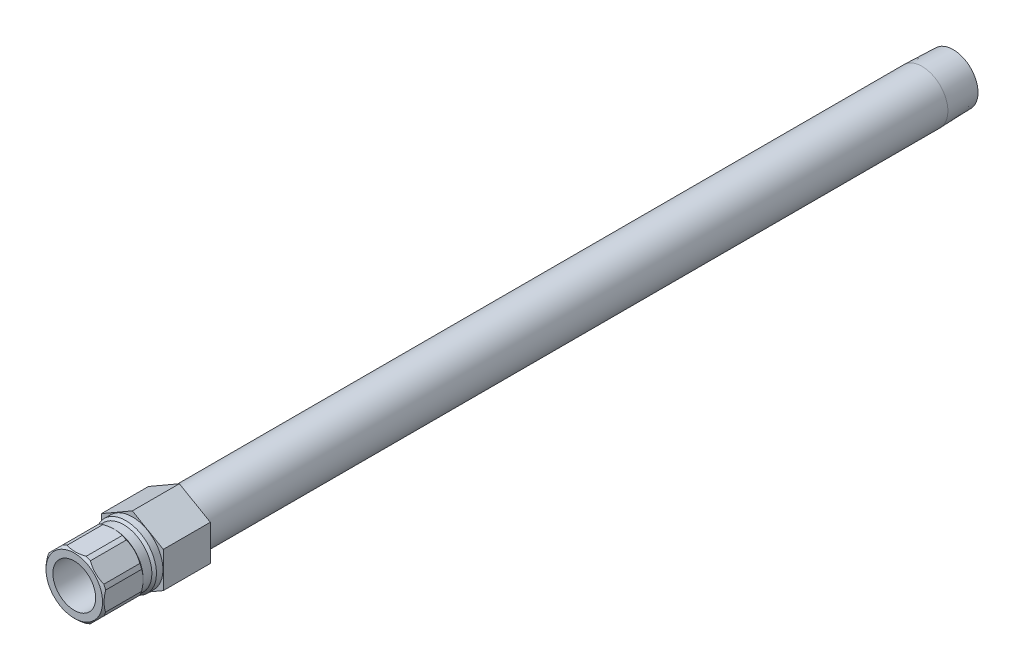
ISO-10303-21;
HEADER;
FILE_DESCRIPTION(('STEP AP214'),'2;1');
FILE_NAME('part.step','',(''),(''),'','','');
FILE_SCHEMA(('AUTOMOTIVE_DESIGN { 1 0 10303 214 1 1 1 1 }'));
ENDSEC;
DATA;
#1=APPLICATION_CONTEXT('core data for automotive mechanical design processes');
#2=APPLICATION_PROTOCOL_DEFINITION('international standard','automotive_design',2000,#1);
#3=PRODUCT_CONTEXT('',#1,'mechanical');
#4=PRODUCT('Part','Part','',(#3));
#5=PRODUCT_RELATED_PRODUCT_CATEGORY('part','',(#4));
#6=PRODUCT_DEFINITION_FORMATION('','',#4);
#7=PRODUCT_DEFINITION_CONTEXT('part definition',#1,'design');
#8=PRODUCT_DEFINITION('design','',#6,#7);
#9=PRODUCT_DEFINITION_SHAPE('','',#8);
#10=(LENGTH_UNIT() NAMED_UNIT(*) SI_UNIT(.MILLI.,.METRE.));
#11=(NAMED_UNIT(*) PLANE_ANGLE_UNIT() SI_UNIT($,.RADIAN.));
#12=(NAMED_UNIT(*) SI_UNIT($,.STERADIAN.) SOLID_ANGLE_UNIT());
#13=UNCERTAINTY_MEASURE_WITH_UNIT(LENGTH_MEASURE(1.E-05),#10,'distance_accuracy_value','');
#14=(GEOMETRIC_REPRESENTATION_CONTEXT(3) GLOBAL_UNCERTAINTY_ASSIGNED_CONTEXT((#13)) GLOBAL_UNIT_ASSIGNED_CONTEXT((#10,
#11,#12)) REPRESENTATION_CONTEXT('',''));
#15=CARTESIAN_POINT('',(0.,0.,0.));
#16=DIRECTION('',(0.,0.,1.));
#17=DIRECTION('',(1.,0.,0.));
#18=AXIS2_PLACEMENT_3D('',#15,#16,#17);
#19=CARTESIAN_POINT('',(0.,0.,0.));
#20=DIRECTION('',(0.,0.,-1.));
#21=DIRECTION('',(0.,1.,0.));
#22=AXIS2_PLACEMENT_3D('',#19,#20,#21);
#23=CYLINDRICAL_SURFACE('',#22,10.16);
#24=DIRECTION('',(0.,0.,-1.));
#25=VECTOR('',#24,1.);
#26=CARTESIAN_POINT('',(9.06826191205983,-4.58172739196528,0.));
#27=LINE('',#26,#25);
#28=CARTESIAN_POINT('',(9.06826191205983,-4.58172739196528,6.5786));
#29=VERTEX_POINT('',#28);
#30=CARTESIAN_POINT('',(9.06826191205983,-4.58172739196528,18.542));
#31=VERTEX_POINT('',#30);
#32=EDGE_CURVE('E525',#29,#31,#27,.F.);
#33=ORIENTED_EDGE('',*,*,#32,.F.);
#34=CARTESIAN_POINT('',(0.,0.,6.5786));
#35=DIRECTION('',(0.,0.,-1.));
#36=DIRECTION('',(0.,1.,0.));
#37=AXIS2_PLACEMENT_3D('',#34,#35,#36);
#38=CIRCLE('',#37,10.16);
#39=CARTESIAN_POINT('',(9.652,-3.17245898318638,6.5786));
#40=VERTEX_POINT('',#39);
#41=EDGE_CURVE('E216',#40,#29,#38,.T.);
#42=ORIENTED_EDGE('',*,*,#41,.F.);
#43=DIRECTION('',(0.,0.,-1.));
#44=VECTOR('',#43,1.);
#45=CARTESIAN_POINT('',(9.652,-3.17245898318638,0.));
#46=LINE('',#45,#44);
#47=CARTESIAN_POINT('',(9.652,-3.17245898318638,18.542));
#48=VERTEX_POINT('',#47);
#49=EDGE_CURVE('E404',#48,#40,#46,.T.);
#50=ORIENTED_EDGE('',*,*,#49,.F.);
#51=CARTESIAN_POINT('',(0.,0.,18.542));
#52=DIRECTION('',(0.,0.,-1.));
#53=DIRECTION('',(0.,1.,0.));
#54=AXIS2_PLACEMENT_3D('',#51,#52,#53);
#55=CIRCLE('',#54,10.16);
#56=EDGE_CURVE('E418',#48,#31,#55,.T.);
#57=ORIENTED_EDGE('',*,*,#56,.T.);
#58=EDGE_LOOP('',(#33,#42,#50,#57));
#59=FACE_BOUND('',#58,.T.);
#60=ADVANCED_FACE('F36',(#59),#23,.T.);
#61=DIRECTION('',(0.,0.,-1.));
#62=VECTOR('',#61,1.);
#63=CARTESIAN_POINT('',(9.652,3.17245898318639,0.));
#64=LINE('',#63,#62);
#65=CARTESIAN_POINT('',(9.652,3.1724589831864,6.57859999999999));
#66=VERTEX_POINT('',#65);
#67=CARTESIAN_POINT('',(9.652,3.17245898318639,18.542));
#68=VERTEX_POINT('',#67);
#69=EDGE_CURVE('E325',#66,#68,#64,.F.);
#70=ORIENTED_EDGE('',*,*,#69,.F.);
#71=CARTESIAN_POINT('',(9.06826191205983,4.58172739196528,6.5786));
#72=VERTEX_POINT('',#71);
#73=EDGE_CURVE('E219',#72,#66,#38,.T.);
#74=ORIENTED_EDGE('',*,*,#73,.F.);
#75=DIRECTION('',(0.,0.,-1.));
#76=VECTOR('',#75,1.);
#77=CARTESIAN_POINT('',(9.06826191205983,4.58172739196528,0.));
#78=LINE('',#77,#76);
#79=CARTESIAN_POINT('',(9.06826191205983,4.58172739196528,18.542));
#80=VERTEX_POINT('',#79);
#81=EDGE_CURVE('E397',#80,#72,#78,.T.);
#82=ORIENTED_EDGE('',*,*,#81,.F.);
#83=EDGE_CURVE('E233',#80,#68,#55,.T.);
#84=ORIENTED_EDGE('',*,*,#83,.T.);
#85=EDGE_LOOP('',(#70,#74,#82,#84));
#86=FACE_BOUND('',#85,.T.);
#87=ADVANCED_FACE('F419',(#86),#23,.T.);
#88=DIRECTION('',(0.,0.,-1.));
#89=VECTOR('',#88,1.);
#90=CARTESIAN_POINT('',(4.58172739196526,9.06826191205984,0.));
#91=LINE('',#90,#89);
#92=CARTESIAN_POINT('',(4.58172739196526,9.06826191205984,6.5786));
#93=VERTEX_POINT('',#92);
#94=CARTESIAN_POINT('',(4.58172739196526,9.06826191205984,18.542));
#95=VERTEX_POINT('',#94);
#96=EDGE_CURVE('E398',#93,#95,#91,.F.);
#97=ORIENTED_EDGE('',*,*,#96,.F.);
#98=CARTESIAN_POINT('',(3.17245898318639,9.652,6.5786));
#99=VERTEX_POINT('',#98);
#100=EDGE_CURVE('E221',#99,#93,#38,.T.);
#101=ORIENTED_EDGE('',*,*,#100,.F.);
#102=DIRECTION('',(0.,0.,-1.));
#103=VECTOR('',#102,1.);
#104=CARTESIAN_POINT('',(3.17245898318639,9.652,0.));
#105=LINE('',#104,#103);
#106=CARTESIAN_POINT('',(3.17245898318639,9.652,18.542));
#107=VERTEX_POINT('',#106);
#108=EDGE_CURVE('E391',#107,#99,#105,.T.);
#109=ORIENTED_EDGE('',*,*,#108,.F.);
#110=EDGE_CURVE('E229',#107,#95,#55,.T.);
#111=ORIENTED_EDGE('',*,*,#110,.T.);
#112=EDGE_LOOP('',(#97,#101,#109,#111));
#113=FACE_BOUND('',#112,.T.);
#114=ADVANCED_FACE('F438',(#113),#23,.T.);
#115=DIRECTION('',(0.,0.,-1.));
#116=VECTOR('',#115,1.);
#117=CARTESIAN_POINT('',(-3.17245898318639,9.652,0.));
#118=LINE('',#117,#116);
#119=CARTESIAN_POINT('',(-3.17245898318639,9.652,6.5786));
#120=VERTEX_POINT('',#119);
#121=CARTESIAN_POINT('',(-3.17245898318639,9.652,18.542));
#122=VERTEX_POINT('',#121);
#123=EDGE_CURVE('E392',#120,#122,#118,.F.);
#124=ORIENTED_EDGE('',*,*,#123,.F.);
#125=CARTESIAN_POINT('',(-4.58172739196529,9.06826191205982,6.5786));
#126=VERTEX_POINT('',#125);
#127=EDGE_CURVE('E226',#126,#120,#38,.T.);
#128=ORIENTED_EDGE('',*,*,#127,.F.);
#129=DIRECTION('',(0.,0.,-1.));
#130=VECTOR('',#129,1.);
#131=CARTESIAN_POINT('',(-4.58172739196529,9.06826191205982,0.));
#132=LINE('',#131,#130);
#133=CARTESIAN_POINT('',(-4.58172739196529,9.06826191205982,18.542));
#134=VERTEX_POINT('',#133);
#135=EDGE_CURVE('E56',#134,#126,#132,.T.);
#136=ORIENTED_EDGE('',*,*,#135,.F.);
#137=EDGE_CURVE('E225',#134,#122,#55,.T.);
#138=ORIENTED_EDGE('',*,*,#137,.T.);
#139=EDGE_LOOP('',(#124,#128,#136,#138));
#140=FACE_BOUND('',#139,.T.);
#141=ADVANCED_FACE('F433',(#140),#23,.T.);
#142=DIRECTION('',(0.,0.,-1.));
#143=VECTOR('',#142,1.);
#144=CARTESIAN_POINT('',(-9.06826191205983,4.58172739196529,0.));
#145=LINE('',#144,#143);
#146=CARTESIAN_POINT('',(-9.06826191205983,4.58172739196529,6.5786));
#147=VERTEX_POINT('',#146);
#148=CARTESIAN_POINT('',(-9.06826191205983,4.58172739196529,18.542));
#149=VERTEX_POINT('',#148);
#150=EDGE_CURVE('E388',#147,#149,#145,.F.);
#151=ORIENTED_EDGE('',*,*,#150,.F.);
#152=CARTESIAN_POINT('',(-9.652,3.17245898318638,6.5786));
#153=VERTEX_POINT('',#152);
#154=EDGE_CURVE('E441',#153,#147,#38,.T.);
#155=ORIENTED_EDGE('',*,*,#154,.F.);
#156=DIRECTION('',(0.,0.,-1.));
#157=VECTOR('',#156,1.);
#158=CARTESIAN_POINT('',(-9.652,3.17245898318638,0.));
#159=LINE('',#158,#157);
#160=CARTESIAN_POINT('',(-9.652,3.17245898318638,18.542));
#161=VERTEX_POINT('',#160);
#162=EDGE_CURVE('E64',#161,#153,#159,.T.);
#163=ORIENTED_EDGE('',*,*,#162,.F.);
#164=EDGE_CURVE('E424',#161,#149,#55,.T.);
#165=ORIENTED_EDGE('',*,*,#164,.T.);
#166=EDGE_LOOP('',(#151,#155,#163,#165));
#167=FACE_BOUND('',#166,.T.);
#168=ADVANCED_FACE('F546',(#167),#23,.T.);
#169=DIRECTION('',(0.,0.,-1.));
#170=VECTOR('',#169,1.);
#171=CARTESIAN_POINT('',(-9.652,-3.17245898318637,0.));
#172=LINE('',#171,#170);
#173=CARTESIAN_POINT('',(-9.652,-3.17245898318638,6.5786));
#174=VERTEX_POINT('',#173);
#175=CARTESIAN_POINT('',(-9.652,-3.17245898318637,18.542));
#176=VERTEX_POINT('',#175);
#177=EDGE_CURVE('E386',#174,#176,#172,.F.);
#178=ORIENTED_EDGE('',*,*,#177,.F.);
#179=CARTESIAN_POINT('',(-9.06826191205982,-4.58172739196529,6.5786));
#180=VERTEX_POINT('',#179);
#181=EDGE_CURVE('E220',#180,#174,#38,.T.);
#182=ORIENTED_EDGE('',*,*,#181,.F.);
#183=DIRECTION('',(0.,0.,-1.));
#184=VECTOR('',#183,1.);
#185=CARTESIAN_POINT('',(-9.06826191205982,-4.58172739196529,0.));
#186=LINE('',#185,#184);
#187=CARTESIAN_POINT('',(-9.06826191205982,-4.58172739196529,18.542));
#188=VERTEX_POINT('',#187);
#189=EDGE_CURVE('E263',#188,#180,#186,.T.);
#190=ORIENTED_EDGE('',*,*,#189,.F.);
#191=EDGE_CURVE('E422',#188,#176,#55,.T.);
#192=ORIENTED_EDGE('',*,*,#191,.T.);
#193=EDGE_LOOP('',(#178,#182,#190,#192));
#194=FACE_BOUND('',#193,.T.);
#195=ADVANCED_FACE('F539',(#194),#23,.T.);
#196=DIRECTION('',(0.,0.,-1.));
#197=VECTOR('',#196,1.);
#198=CARTESIAN_POINT('',(-4.58172739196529,-9.06826191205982,0.));
#199=LINE('',#198,#197);
#200=CARTESIAN_POINT('',(-4.58172739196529,-9.06826191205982,6.5786));
#201=VERTEX_POINT('',#200);
#202=CARTESIAN_POINT('',(-4.58172739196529,-9.06826191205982,18.542));
#203=VERTEX_POINT('',#202);
#204=EDGE_CURVE('E376',#201,#203,#199,.F.);
#205=ORIENTED_EDGE('',*,*,#204,.F.);
#206=CARTESIAN_POINT('',(-3.17245898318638,-9.652,6.5786));
#207=VERTEX_POINT('',#206);
#208=EDGE_CURVE('E217',#207,#201,#38,.T.);
#209=ORIENTED_EDGE('',*,*,#208,.F.);
#210=DIRECTION('',(0.,0.,-1.));
#211=VECTOR('',#210,1.);
#212=CARTESIAN_POINT('',(-3.17245898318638,-9.652,0.));
#213=LINE('',#212,#211);
#214=CARTESIAN_POINT('',(-3.17245898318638,-9.652,18.542));
#215=VERTEX_POINT('',#214);
#216=EDGE_CURVE('E194',#215,#207,#213,.T.);
#217=ORIENTED_EDGE('',*,*,#216,.F.);
#218=EDGE_CURVE('E385',#215,#203,#55,.T.);
#219=ORIENTED_EDGE('',*,*,#218,.T.);
#220=EDGE_LOOP('',(#205,#209,#217,#219));
#221=FACE_BOUND('',#220,.T.);
#222=ADVANCED_FACE('F383',(#221),#23,.T.);
#223=CARTESIAN_POINT('',(0.,0.,0.));
#224=DIRECTION('',(0.,0.,-1.));
#225=DIRECTION('',(0.,1.,0.));
#226=AXIS2_PLACEMENT_3D('',#223,#224,#225);
#227=CYLINDRICAL_SURFACE('',#226,8.5725);
#228=CARTESIAN_POINT('',(0.,0.,-262.4582));
#229=DIRECTION('',(0.,0.,-1.));
#230=DIRECTION('',(0.,1.,0.));
#231=AXIS2_PLACEMENT_3D('',#228,#229,#230);
#232=CIRCLE('',#231,8.57250000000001);
#233=CARTESIAN_POINT('',(0.,8.5725,-262.4582));
#234=VERTEX_POINT('',#233);
#235=EDGE_CURVE('E456',#234,#234,#232,.T.);
#236=ORIENTED_EDGE('',*,*,#235,.F.);
#237=EDGE_LOOP('',(#236));
#238=FACE_BOUND('',#237,.T.);
#239=CARTESIAN_POINT('',(0.,0.,-15.621));
#240=DIRECTION('',(0.,0.,1.));
#241=DIRECTION('',(1.,0.,0.));
#242=AXIS2_PLACEMENT_3D('',#239,#240,#241);
#243=CIRCLE('',#242,8.5725);
#244=CARTESIAN_POINT('',(8.5725,0.,-15.621));
#245=VERTEX_POINT('',#244);
#246=EDGE_CURVE('E471',#245,#245,#243,.F.);
#247=ORIENTED_EDGE('',*,*,#246,.T.);
#248=EDGE_LOOP('',(#247));
#249=FACE_BOUND('',#248,.T.);
#250=ADVANCED_FACE('F538',(#238,#249),#227,.T.);
#251=CARTESIAN_POINT('',(0.,0.,0.));
#252=DIRECTION('',(0.,0.,-1.));
#253=DIRECTION('',(0.,1.,0.));
#254=AXIS2_PLACEMENT_3D('',#251,#252,#253);
#255=CYLINDRICAL_SURFACE('',#254,7.112);
#256=CARTESIAN_POINT('',(0.,0.,1.524));
#257=DIRECTION('',(0.,0.,-1.));
#258=DIRECTION('',(0.,1.,0.));
#259=AXIS2_PLACEMENT_3D('',#256,#257,#258);
#260=CIRCLE('',#259,7.112);
#261=CARTESIAN_POINT('',(0.,7.112,1.524));
#262=VERTEX_POINT('',#261);
#263=EDGE_CURVE('E468',#262,#262,#260,.T.);
#264=ORIENTED_EDGE('',*,*,#263,.T.);
#265=EDGE_LOOP('',(#264));
#266=FACE_BOUND('',#265,.T.);
#267=CARTESIAN_POINT('',(0.,0.,19.304));
#268=DIRECTION('',(0.,0.,-1.));
#269=DIRECTION('',(0.,1.,0.));
#270=AXIS2_PLACEMENT_3D('',#267,#268,#269);
#271=CIRCLE('',#270,7.112);
#272=CARTESIAN_POINT('',(0.,7.112,19.304));
#273=VERTEX_POINT('',#272);
#274=EDGE_CURVE('E200',#273,#273,#271,.T.);
#275=ORIENTED_EDGE('',*,*,#274,.F.);
#276=EDGE_LOOP('',(#275));
#277=FACE_BOUND('',#276,.T.);
#278=ADVANCED_FACE('F38',(#266,#277),#255,.F.);
#279=CARTESIAN_POINT('',(0.,7.112,19.304));
#280=DIRECTION('',(0.,0.,1.));
#281=DIRECTION('',(0.,-1.,0.));
#282=AXIS2_PLACEMENT_3D('',#279,#280,#281);
#283=PLANE('',#282);
#284=ORIENTED_EDGE('',*,*,#274,.T.);
#285=EDGE_LOOP('',(#284));
#286=FACE_BOUND('',#285,.T.);
#287=CARTESIAN_POINT('',(0.,0.,19.304));
#288=DIRECTION('',(0.,0.,-1.));
#289=DIRECTION('',(0.,1.,0.));
#290=AXIS2_PLACEMENT_3D('',#287,#288,#289);
#291=CIRCLE('',#290,9.398);
#292=CARTESIAN_POINT('',(0.,9.398,19.304));
#293=VERTEX_POINT('',#292);
#294=EDGE_CURVE('E232',#293,#293,#291,.T.);
#295=ORIENTED_EDGE('',*,*,#294,.F.);
#296=EDGE_LOOP('',(#295));
#297=FACE_BOUND('',#296,.T.);
#298=ADVANCED_FACE('F269',(#286,#297),#283,.T.);
#299=CARTESIAN_POINT('',(0.,0.,18.542));
#300=DIRECTION('',(0.,0.,-1.));
#301=DIRECTION('',(0.,1.,0.));
#302=AXIS2_PLACEMENT_3D('',#299,#300,#301);
#303=CONICAL_SURFACE('',#302,10.16,0.785398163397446);
#304=CARTESIAN_POINT('',(9.06871478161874,-4.58127452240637,18.5418));
#305=CARTESIAN_POINT('',(8.89746651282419,-4.75252279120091,18.6174888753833));
#306=CARTESIAN_POINT('',(8.72454398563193,-4.92544531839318,18.6860001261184));
#307=CARTESIAN_POINT('',(8.37571487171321,-5.2742744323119,18.8068689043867));
#308=CARTESIAN_POINT('',(8.19980528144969,-5.45018402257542,18.85920901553));
#309=CARTESIAN_POINT('',(7.8498282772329,-5.80016102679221,18.9447662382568));
#310=CARTESIAN_POINT('',(7.67581225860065,-5.97417704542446,18.9783973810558));
#311=CARTESIAN_POINT('',(7.32656572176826,-6.32342358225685,19.0270891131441));
#312=CARTESIAN_POINT('',(7.15133584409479,-6.49865345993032,19.0421588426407));
#313=CARTESIAN_POINT('',(6.77605057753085,-6.87393872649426,19.0538859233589));
#314=CARTESIAN_POINT('',(6.57594647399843,-7.07404283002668,19.0476773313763));
#315=CARTESIAN_POINT('',(6.17675989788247,-7.47322940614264,19.0106603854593));
#316=CARTESIAN_POINT('',(5.97767829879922,-7.67231100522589,18.9798336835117));
#317=CARTESIAN_POINT('',(5.57666706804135,-8.07332223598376,18.8939894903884));
#318=CARTESIAN_POINT('',(5.37480504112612,-8.27518426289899,18.8383431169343));
#319=CARTESIAN_POINT('',(5.07491153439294,-8.57507776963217,18.7386783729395));
#320=CARTESIAN_POINT('',(4.97548345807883,-8.67450584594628,18.7027814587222));
#321=CARTESIAN_POINT('',(4.77762502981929,-8.87236427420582,18.6259657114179));
#322=CARTESIAN_POINT('',(4.67919445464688,-8.97079484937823,18.5850480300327));
#323=CARTESIAN_POINT('',(4.58127452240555,-9.06871478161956,18.5417999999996));
#324=B_SPLINE_CURVE_WITH_KNOTS('',3,(#304,#305,#306,#307,#308,#309,#310,#311,#312,#313,#314,
#315,#316,#317,#318,#319,#320,#321,#322,#323),.UNSPECIFIED.,.F.,.F.,(4,2,2,2,2,2,2,2,2,4),(0.,
0.761268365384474,1.52335378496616,2.26782503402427,3.01192953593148,3.85997332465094,
4.70864975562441,5.58017277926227,6.01546212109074,6.4506517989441),.UNSPECIFIED.);
#325=CARTESIAN_POINT('',(4.58172739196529,-9.06826191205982,18.542));
#326=VERTEX_POINT('',#325);
#327=EDGE_CURVE('E506',#31,#326,#324,.T.);
#328=ORIENTED_EDGE('',*,*,#327,.F.);
#329=ORIENTED_EDGE('',*,*,#56,.F.);
#330=CARTESIAN_POINT('',(9.652,-7.71050187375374,16.3483388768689));
#331=CARTESIAN_POINT('',(9.652,-7.52475481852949,16.4642553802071));
#332=CARTESIAN_POINT('',(9.652,-7.33786285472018,16.5783624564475));
#333=CARTESIAN_POINT('',(9.652,-6.96152272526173,16.8023812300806));
#334=CARTESIAN_POINT('',(9.652,-6.77207395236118,16.9122919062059));
#335=CARTESIAN_POINT('',(9.652,-6.38961701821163,17.1277502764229));
#336=CARTESIAN_POINT('',(9.652,-6.19659699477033,17.2332770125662));
#337=CARTESIAN_POINT('',(9.652,-5.80760245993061,17.4386922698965));
#338=CARTESIAN_POINT('',(9.652,-5.6116281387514,17.5385811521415));
#339=CARTESIAN_POINT('',(9.652,-5.01021259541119,17.8328232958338));
#340=CARTESIAN_POINT('',(9.652,-4.59965798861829,18.0169416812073));
#341=CARTESIAN_POINT('',(9.652,-3.76461195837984,18.3488686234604));
#342=CARTESIAN_POINT('',(9.652,-3.34014745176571,18.4967430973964));
#343=CARTESIAN_POINT('',(9.652,-2.66836152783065,18.6905975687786));
#344=CARTESIAN_POINT('',(9.652,-2.42567962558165,18.7527238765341));
#345=CARTESIAN_POINT('',(9.652,-1.9366245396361,18.860517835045));
#346=CARTESIAN_POINT('',(9.652,-1.69025117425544,18.9061846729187));
#347=CARTESIAN_POINT('',(9.652,-1.1971622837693,18.9790662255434));
#348=CARTESIAN_POINT('',(9.652,-0.95047238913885,19.0064526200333));
#349=CARTESIAN_POINT('',(9.652,-0.45571021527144,19.0423990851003));
#350=CARTESIAN_POINT('',(9.652,-0.207637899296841,19.0509586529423));
#351=CARTESIAN_POINT('',(9.652,0.333683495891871,19.048681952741));
#352=CARTESIAN_POINT('',(9.652,0.626923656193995,19.0340251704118));
#353=CARTESIAN_POINT('',(9.652,1.21094277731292,18.9786837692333));
#354=CARTESIAN_POINT('',(9.652,1.501721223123,18.9379938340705));
#355=CARTESIAN_POINT('',(9.652,2.08266136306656,18.8320509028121));
#356=CARTESIAN_POINT('',(9.652,2.3727646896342,18.7664820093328));
#357=CARTESIAN_POINT('',(9.652,2.94714147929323,18.6138865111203));
#358=CARTESIAN_POINT('',(9.652,3.23141585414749,18.5268632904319));
#359=CARTESIAN_POINT('',(9.652,3.82869981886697,18.3226103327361));
#360=CARTESIAN_POINT('',(9.652,4.14087760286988,18.2029681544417));
#361=CARTESIAN_POINT('',(9.652,4.75742701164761,17.9448741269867));
#362=CARTESIAN_POINT('',(9.652,5.0617950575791,17.8064138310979));
#363=CARTESIAN_POINT('',(9.652,5.66409479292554,17.5139015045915));
#364=CARTESIAN_POINT('',(9.652,5.96200267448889,17.3598008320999));
#365=CARTESIAN_POINT('',(9.652,6.55107386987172,17.0393844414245));
#366=CARTESIAN_POINT('',(9.652,6.84223818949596,16.8730705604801));
#367=CARTESIAN_POINT('',(9.652,7.40668231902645,16.5376791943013));
#368=CARTESIAN_POINT('',(9.652,7.68020242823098,16.3690040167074));
#369=CARTESIAN_POINT('',(9.652,8.22250898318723,16.0241853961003));
#370=CARTESIAN_POINT('',(9.652,8.49129505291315,15.848041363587));
#371=CARTESIAN_POINT('',(9.652,9.02258177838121,15.4910339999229));
#372=CARTESIAN_POINT('',(9.652,9.28511552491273,15.3102197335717));
#373=CARTESIAN_POINT('',(9.652,9.80652727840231,14.9435456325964));
#374=CARTESIAN_POINT('',(9.652,10.0654063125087,14.7576872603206));
#375=CARTESIAN_POINT('',(9.652,10.3227473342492,14.5697596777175));
#376=B_SPLINE_CURVE_WITH_KNOTS('',3,(#330,#331,#332,#333,#334,#335,#336,#337,#338,#339,#340,
#341,#342,#343,#344,#345,#346,#347,#348,#349,#350,#351,#352,#353,#354,#355,#356,#357,#358,#359,
#360,#361,#362,#363,#364,#365,#366,#367,#368,#369,#370,#371,#372,#373,#374,#375),.UNSPECIFIED.,
.F.,.F.,(4,2,2,2,2,2,2,2,2,2,2,2,2,2,2,2,2,2,2,2,2,2,4),(0.,0.656855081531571,1.31386901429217,
1.97372850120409,2.63354568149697,3.98211483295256,5.32821282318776,6.07925616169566,
6.83033658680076,7.5742601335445,8.31820354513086,9.1977741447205,10.0775244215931,
10.9688407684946,11.8600166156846,12.8622077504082,13.8648502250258,14.8707124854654,
15.8764237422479,16.8403261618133,17.8043048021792,18.7605668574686,19.7165545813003),.UNSPECIFIED.);
#377=EDGE_CURVE('E317',#68,#48,#376,.F.);
#378=ORIENTED_EDGE('',*,*,#377,.F.);
#379=ORIENTED_EDGE('',*,*,#83,.F.);
#380=CARTESIAN_POINT('',(4.58127452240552,9.06871478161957,18.5417999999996));
#381=CARTESIAN_POINT('',(4.75252279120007,8.89746651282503,18.617488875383));
#382=CARTESIAN_POINT('',(4.92544531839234,8.72454398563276,18.6860001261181));
#383=CARTESIAN_POINT('',(5.27427443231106,8.37571487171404,18.8068689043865));
#384=CARTESIAN_POINT('',(5.45018402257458,8.19980528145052,18.8592090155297));
#385=CARTESIAN_POINT('',(5.80016102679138,7.84982827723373,18.9447662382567));
#386=CARTESIAN_POINT('',(5.97417704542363,7.67581225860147,18.9783973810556));
#387=CARTESIAN_POINT('',(6.32342358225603,7.32656572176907,19.027089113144));
#388=CARTESIAN_POINT('',(6.4986534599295,7.1513358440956,19.0421588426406));
#389=CARTESIAN_POINT('',(6.87393872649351,6.77605057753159,19.0538859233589));
#390=CARTESIAN_POINT('',(7.074042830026,6.57594647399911,19.0476773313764));
#391=CARTESIAN_POINT('',(7.4732294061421,6.17675989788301,19.0106603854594));
#392=CARTESIAN_POINT('',(7.67231100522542,5.97767829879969,18.9798336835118));
#393=CARTESIAN_POINT('',(8.07332223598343,5.57666706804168,18.8939894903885));
#394=CARTESIAN_POINT('',(8.27518426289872,5.37480504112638,18.8383431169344));
#395=CARTESIAN_POINT('',(8.57507776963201,5.07491153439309,18.7386783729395));
#396=CARTESIAN_POINT('',(8.67450584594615,4.97548345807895,18.7027814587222));
#397=CARTESIAN_POINT('',(8.87236427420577,4.77762502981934,18.6259657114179));
#398=CARTESIAN_POINT('',(8.9707948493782,4.6791944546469,18.5850480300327));
#399=CARTESIAN_POINT('',(9.06871478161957,4.58127452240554,18.5417999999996));
#400=B_SPLINE_CURVE_WITH_KNOTS('',3,(#380,#381,#382,#383,#384,#385,#386,#387,#388,#389,#390,
#391,#392,#393,#394,#395,#396,#397,#398,#399),.UNSPECIFIED.,.F.,.F.,(4,2,2,2,2,2,2,2,2,4),(0.,
0.761268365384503,1.52335378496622,2.26782503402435,3.01192953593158,3.85997332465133,
4.70864975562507,5.58017277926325,6.01546212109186,6.45065179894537),.UNSPECIFIED.);
#401=EDGE_CURVE('E309',#95,#80,#400,.T.);
#402=ORIENTED_EDGE('',*,*,#401,.F.);
#403=ORIENTED_EDGE('',*,*,#110,.F.);
#404=CARTESIAN_POINT('',(-7.71050187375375,9.652,16.3483388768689));
#405=CARTESIAN_POINT('',(-7.5247548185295,9.652,16.4642553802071));
#406=CARTESIAN_POINT('',(-7.33786285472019,9.652,16.5783624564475));
#407=CARTESIAN_POINT('',(-6.96152272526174,9.652,16.8023812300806));
#408=CARTESIAN_POINT('',(-6.77207395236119,9.652,16.9122919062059));
#409=CARTESIAN_POINT('',(-6.38961701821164,9.652,17.1277502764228));
#410=CARTESIAN_POINT('',(-6.19659699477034,9.652,17.2332770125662));
#411=CARTESIAN_POINT('',(-5.80760245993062,9.652,17.4386922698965));
#412=CARTESIAN_POINT('',(-5.61162813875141,9.652,17.5385811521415));
#413=CARTESIAN_POINT('',(-5.0102125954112,9.652,17.8328232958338));
#414=CARTESIAN_POINT('',(-4.5996579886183,9.652,18.0169416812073));
#415=CARTESIAN_POINT('',(-3.76461195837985,9.652,18.3488686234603));
#416=CARTESIAN_POINT('',(-3.34014745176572,9.652,18.4967430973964));
#417=CARTESIAN_POINT('',(-2.66836152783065,9.652,18.6905975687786));
#418=CARTESIAN_POINT('',(-2.42567962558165,9.652,18.7527238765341));
#419=CARTESIAN_POINT('',(-1.9366245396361,9.652,18.860517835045));
#420=CARTESIAN_POINT('',(-1.69025117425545,9.652,18.9061846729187));
#421=CARTESIAN_POINT('',(-1.19716228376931,9.652,18.9790662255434));
#422=CARTESIAN_POINT('',(-0.950472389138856,9.652,19.0064526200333));
#423=CARTESIAN_POINT('',(-0.455710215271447,9.652,19.0423990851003));
#424=CARTESIAN_POINT('',(-0.207637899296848,9.652,19.0509586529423));
#425=CARTESIAN_POINT('',(0.333683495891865,9.652,19.048681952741));
#426=CARTESIAN_POINT('',(0.626923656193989,9.652,19.0340251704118));
#427=CARTESIAN_POINT('',(1.21094277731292,9.652,18.9786837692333));
#428=CARTESIAN_POINT('',(1.50172122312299,9.652,18.9379938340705));
#429=CARTESIAN_POINT('',(2.08266136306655,9.652,18.8320509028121));
#430=CARTESIAN_POINT('',(2.3727646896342,9.652,18.7664820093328));
#431=CARTESIAN_POINT('',(2.94714147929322,9.652,18.6138865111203));
#432=CARTESIAN_POINT('',(3.23141585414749,9.652,18.5268632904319));
#433=CARTESIAN_POINT('',(3.82869981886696,9.652,18.3226103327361));
#434=CARTESIAN_POINT('',(4.14087760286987,9.652,18.2029681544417));
#435=CARTESIAN_POINT('',(4.7574270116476,9.652,17.9448741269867));
#436=CARTESIAN_POINT('',(5.06179505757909,9.652,17.8064138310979));
#437=CARTESIAN_POINT('',(5.66409479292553,9.652,17.5139015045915));
#438=CARTESIAN_POINT('',(5.96200267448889,9.652,17.3598008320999));
#439=CARTESIAN_POINT('',(6.55107386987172,9.652,17.0393844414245));
#440=CARTESIAN_POINT('',(6.84223818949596,9.652,16.8730705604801));
#441=CARTESIAN_POINT('',(7.40668231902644,9.652,16.5376791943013));
#442=CARTESIAN_POINT('',(7.68020242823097,9.652,16.3690040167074));
#443=CARTESIAN_POINT('',(8.22250898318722,9.652,16.0241853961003));
#444=CARTESIAN_POINT('',(8.49129505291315,9.652,15.848041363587));
#445=CARTESIAN_POINT('',(9.0225817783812,9.652,15.4910339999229));
#446=CARTESIAN_POINT('',(9.28511552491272,9.652,15.3102197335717));
#447=CARTESIAN_POINT('',(9.8065272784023,9.652,14.9435456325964));
#448=CARTESIAN_POINT('',(10.0654063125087,9.652,14.7576872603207));
#449=CARTESIAN_POINT('',(10.3227473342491,9.652,14.5697596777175));
#450=B_SPLINE_CURVE_WITH_KNOTS('',3,(#404,#405,#406,#407,#408,#409,#410,#411,#412,#413,#414,
#415,#416,#417,#418,#419,#420,#421,#422,#423,#424,#425,#426,#427,#428,#429,#430,#431,#432,#433,
#434,#435,#436,#437,#438,#439,#440,#441,#442,#443,#444,#445,#446,#447,#448,#449),.UNSPECIFIED.,
.F.,.F.,(4,2,2,2,2,2,2,2,2,2,2,2,2,2,2,2,2,2,2,2,2,2,4),(0.,0.656855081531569,1.31386901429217,
1.97372850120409,2.63354568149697,3.98211483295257,5.32821282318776,6.07925616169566,
6.83033658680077,7.57426013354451,8.31820354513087,9.1977741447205,10.0775244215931,
10.9688407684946,11.8600166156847,12.8622077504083,13.8648502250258,14.8707124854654,
15.8764237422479,16.8403261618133,17.8043048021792,18.7605668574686,19.7165545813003),.UNSPECIFIED.);
#451=EDGE_CURVE('E301',#122,#107,#450,.T.);
#452=ORIENTED_EDGE('',*,*,#451,.F.);
#453=ORIENTED_EDGE('',*,*,#137,.F.);
#454=CARTESIAN_POINT('',(-9.06871478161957,4.58127452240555,18.5417999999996));
#455=CARTESIAN_POINT('',(-8.89746651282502,4.75252279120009,18.617488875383));
#456=CARTESIAN_POINT('',(-8.72454398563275,4.92544531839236,18.6860001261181));
#457=CARTESIAN_POINT('',(-8.37571487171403,5.27427443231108,18.8068689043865));
#458=CARTESIAN_POINT('',(-8.19980528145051,5.4501840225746,18.8592090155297));
#459=CARTESIAN_POINT('',(-7.84982827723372,5.80016102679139,18.9447662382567));
#460=CARTESIAN_POINT('',(-7.67581225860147,5.97417704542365,18.9783973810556));
#461=CARTESIAN_POINT('',(-7.32656572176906,6.32342358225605,19.027089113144));
#462=CARTESIAN_POINT('',(-7.15133584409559,6.49865345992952,19.0421588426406));
#463=CARTESIAN_POINT('',(-6.77605057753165,6.87393872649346,19.0538859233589));
#464=CARTESIAN_POINT('',(-6.57594647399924,7.07404283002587,19.0476773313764));
#465=CARTESIAN_POINT('',(-6.17675989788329,7.47322940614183,19.0106603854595));
#466=CARTESIAN_POINT('',(-5.97767829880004,7.67231100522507,18.9798336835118));
#467=CARTESIAN_POINT('',(-5.57666706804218,8.07332223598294,18.8939894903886));
#468=CARTESIAN_POINT('',(-5.37480504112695,8.27518426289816,18.8383431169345));
#469=CARTESIAN_POINT('',(-5.07491153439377,8.57507776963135,18.7386783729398));
#470=CARTESIAN_POINT('',(-4.97548345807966,8.67450584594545,18.7027814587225));
#471=CARTESIAN_POINT('',(-4.77762502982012,8.872364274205,18.6259657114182));
#472=CARTESIAN_POINT('',(-4.67919445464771,8.9707948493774,18.585048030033));
#473=CARTESIAN_POINT('',(-4.58127452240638,9.06871478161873,18.5418));
#474=B_SPLINE_CURVE_WITH_KNOTS('',3,(#454,#455,#456,#457,#458,#459,#460,#461,#462,#463,#464,
#465,#466,#467,#468,#469,#470,#471,#472,#473),.UNSPECIFIED.,.F.,.F.,(4,2,2,2,2,2,2,2,2,4),(0.,
0.761268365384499,1.52335378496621,2.26782503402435,3.01192953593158,3.85997332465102,
4.70864975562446,5.5801727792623,6.01546212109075,6.4506517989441),.UNSPECIFIED.);
#475=EDGE_CURVE('E292',#149,#134,#474,.T.);
#476=ORIENTED_EDGE('',*,*,#475,.F.);
#477=ORIENTED_EDGE('',*,*,#164,.F.);
#478=CARTESIAN_POINT('',(-9.652,-7.71050187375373,16.3483388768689));
#479=CARTESIAN_POINT('',(-9.652,-7.52475481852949,16.4642553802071));
#480=CARTESIAN_POINT('',(-9.652,-7.33786285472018,16.5783624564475));
#481=CARTESIAN_POINT('',(-9.652,-6.96152272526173,16.8023812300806));
#482=CARTESIAN_POINT('',(-9.652,-6.77207395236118,16.9122919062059));
#483=CARTESIAN_POINT('',(-9.652,-6.38961701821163,17.1277502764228));
#484=CARTESIAN_POINT('',(-9.652,-6.19659699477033,17.2332770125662));
#485=CARTESIAN_POINT('',(-9.652,-5.8076024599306,17.4386922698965));
#486=CARTESIAN_POINT('',(-9.652,-5.6116281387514,17.5385811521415));
#487=CARTESIAN_POINT('',(-9.652,-5.01021259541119,17.8328232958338));
#488=CARTESIAN_POINT('',(-9.652,-4.59965798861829,18.0169416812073));
#489=CARTESIAN_POINT('',(-9.652,-3.76461195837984,18.3488686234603));
#490=CARTESIAN_POINT('',(-9.652,-3.34014745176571,18.4967430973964));
#491=CARTESIAN_POINT('',(-9.652,-2.66836152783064,18.6905975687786));
#492=CARTESIAN_POINT('',(-9.652,-2.42567962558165,18.7527238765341));
#493=CARTESIAN_POINT('',(-9.652,-1.9366245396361,18.860517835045));
#494=CARTESIAN_POINT('',(-9.652,-1.69025117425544,18.9061846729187));
#495=CARTESIAN_POINT('',(-9.652,-1.1971622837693,18.9790662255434));
#496=CARTESIAN_POINT('',(-9.652,-0.950472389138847,19.0064526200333));
#497=CARTESIAN_POINT('',(-9.652,-0.455710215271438,19.0423990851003));
#498=CARTESIAN_POINT('',(-9.652,-0.207637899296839,19.0509586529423));
#499=CARTESIAN_POINT('',(-9.652,0.333683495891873,19.048681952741));
#500=CARTESIAN_POINT('',(-9.652,0.626923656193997,19.0340251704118));
#501=CARTESIAN_POINT('',(-9.652,1.21094277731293,18.9786837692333));
#502=CARTESIAN_POINT('',(-9.652,1.501721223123,18.9379938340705));
#503=CARTESIAN_POINT('',(-9.652,2.08266136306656,18.8320509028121));
#504=CARTESIAN_POINT('',(-9.652,2.3727646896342,18.7664820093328));
#505=CARTESIAN_POINT('',(-9.652,2.94714147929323,18.6138865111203));
#506=CARTESIAN_POINT('',(-9.652,3.23141585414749,18.5268632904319));
#507=CARTESIAN_POINT('',(-9.652,3.82869981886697,18.3226103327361));
#508=CARTESIAN_POINT('',(-9.652,4.14087760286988,18.2029681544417));
#509=CARTESIAN_POINT('',(-9.652,4.75742701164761,17.9448741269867));
#510=CARTESIAN_POINT('',(-9.652,5.0617950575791,17.8064138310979));
#511=CARTESIAN_POINT('',(-9.652,5.66409479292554,17.5139015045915));
#512=CARTESIAN_POINT('',(-9.652,5.9620026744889,17.3598008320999));
#513=CARTESIAN_POINT('',(-9.652,6.55107386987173,17.0393844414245));
#514=CARTESIAN_POINT('',(-9.652,6.84223818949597,16.8730705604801));
#515=CARTESIAN_POINT('',(-9.652,7.40668231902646,16.5376791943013));
#516=CARTESIAN_POINT('',(-9.652,7.68020242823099,16.3690040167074));
#517=CARTESIAN_POINT('',(-9.652,8.22250898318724,16.0241853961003));
#518=CARTESIAN_POINT('',(-9.652,8.49129505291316,15.848041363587));
#519=CARTESIAN_POINT('',(-9.652,9.02258177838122,15.4910339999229));
#520=CARTESIAN_POINT('',(-9.652,9.28511552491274,15.3102197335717));
#521=CARTESIAN_POINT('',(-9.652,9.80652727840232,14.9435456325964));
#522=CARTESIAN_POINT('',(-9.652,10.0654063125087,14.7576872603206));
#523=CARTESIAN_POINT('',(-9.652,10.3227473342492,14.5697596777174));
#524=B_SPLINE_CURVE_WITH_KNOTS('',3,(#478,#479,#480,#481,#482,#483,#484,#485,#486,#487,#488,
#489,#490,#491,#492,#493,#494,#495,#496,#497,#498,#499,#500,#501,#502,#503,#504,#505,#506,#507,
#508,#509,#510,#511,#512,#513,#514,#515,#516,#517,#518,#519,#520,#521,#522,#523),.UNSPECIFIED.,
.F.,.F.,(4,2,2,2,2,2,2,2,2,2,2,2,2,2,2,2,2,2,2,2,2,2,4),(0.,0.656855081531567,1.31386901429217,
1.97372850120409,2.63354568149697,3.98211483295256,5.32821282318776,6.07925616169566,
6.83033658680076,7.5742601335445,8.31820354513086,9.1977741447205,10.0775244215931,
10.9688407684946,11.8600166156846,12.8622077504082,13.8648502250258,14.8707124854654,
15.8764237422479,16.8403261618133,17.8043048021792,18.7605668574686,19.7165545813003),.UNSPECIFIED.);
#525=EDGE_CURVE('E284',#176,#161,#524,.T.);
#526=ORIENTED_EDGE('',*,*,#525,.F.);
#527=ORIENTED_EDGE('',*,*,#191,.F.);
#528=CARTESIAN_POINT('',(-4.58127452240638,-9.06871478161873,18.5418));
#529=CARTESIAN_POINT('',(-4.75252279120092,-8.89746651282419,18.6174888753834));
#530=CARTESIAN_POINT('',(-4.92544531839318,-8.72454398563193,18.6860001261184));
#531=CARTESIAN_POINT('',(-5.2742744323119,-8.37571487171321,18.8068689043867));
#532=CARTESIAN_POINT('',(-5.45018402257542,-8.19980528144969,18.85920901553));
#533=CARTESIAN_POINT('',(-5.80016102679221,-7.8498282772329,18.9447662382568));
#534=CARTESIAN_POINT('',(-5.97417704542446,-7.67581225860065,18.9783973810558));
#535=CARTESIAN_POINT('',(-6.32342358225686,-7.32656572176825,19.0270891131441));
#536=CARTESIAN_POINT('',(-6.49865345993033,-7.15133584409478,19.0421588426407));
#537=CARTESIAN_POINT('',(-6.87393872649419,-6.77605057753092,19.0538859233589));
#538=CARTESIAN_POINT('',(-7.07404283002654,-6.57594647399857,19.0476773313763));
#539=CARTESIAN_POINT('',(-7.47322940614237,-6.17675989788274,19.0106603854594));
#540=CARTESIAN_POINT('',(-7.67231100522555,-5.97767829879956,18.9798336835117));
#541=CARTESIAN_POINT('',(-8.07332223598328,-5.57666706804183,18.8939894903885));
#542=CARTESIAN_POINT('',(-8.27518426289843,-5.37480504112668,18.8383431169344));
#543=CARTESIAN_POINT('',(-8.57507776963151,-5.0749115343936,18.7386783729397));
#544=CARTESIAN_POINT('',(-8.67450584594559,-4.97548345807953,18.7027814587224));
#545=CARTESIAN_POINT('',(-8.87236427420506,-4.77762502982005,18.6259657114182));
#546=CARTESIAN_POINT('',(-8.97079484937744,-4.67919445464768,18.585048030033));
#547=CARTESIAN_POINT('',(-9.06871478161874,-4.58127452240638,18.5418));
#548=B_SPLINE_CURVE_WITH_KNOTS('',3,(#528,#529,#530,#531,#532,#533,#534,#535,#536,#537,#538,
#539,#540,#541,#542,#543,#544,#545,#546,#547),.UNSPECIFIED.,.F.,.F.,(4,2,2,2,2,2,2,2,2,4),(0.,
0.761268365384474,1.52335378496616,2.26782503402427,3.01192953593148,3.85997332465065,
4.70864975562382,5.58017277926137,6.01546212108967,6.45065179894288),.UNSPECIFIED.);
#549=EDGE_CURVE('E277',#203,#188,#548,.T.);
#550=ORIENTED_EDGE('',*,*,#549,.F.);
#551=ORIENTED_EDGE('',*,*,#218,.F.);
#552=CARTESIAN_POINT('',(-7.71050187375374,-9.652,16.3483388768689));
#553=CARTESIAN_POINT('',(-7.52475481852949,-9.652,16.4642553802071));
#554=CARTESIAN_POINT('',(-7.33786285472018,-9.652,16.5783624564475));
#555=CARTESIAN_POINT('',(-6.96152272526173,-9.652,16.8023812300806));
#556=CARTESIAN_POINT('',(-6.77207395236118,-9.652,16.9122919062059));
#557=CARTESIAN_POINT('',(-6.38961701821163,-9.652,17.1277502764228));
#558=CARTESIAN_POINT('',(-6.19659699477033,-9.652,17.2332770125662));
#559=CARTESIAN_POINT('',(-5.80760245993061,-9.652,17.4386922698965));
#560=CARTESIAN_POINT('',(-5.6116281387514,-9.652,17.5385811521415));
#561=CARTESIAN_POINT('',(-5.01021259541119,-9.652,17.8328232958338));
#562=CARTESIAN_POINT('',(-4.59965798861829,-9.652,18.0169416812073));
#563=CARTESIAN_POINT('',(-3.76461195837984,-9.652,18.3488686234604));
#564=CARTESIAN_POINT('',(-3.34014745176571,-9.652,18.4967430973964));
#565=CARTESIAN_POINT('',(-2.66836152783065,-9.652,18.6905975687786));
#566=CARTESIAN_POINT('',(-2.42567962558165,-9.652,18.7527238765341));
#567=CARTESIAN_POINT('',(-1.9366245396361,-9.652,18.860517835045));
#568=CARTESIAN_POINT('',(-1.69025117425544,-9.652,18.9061846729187));
#569=CARTESIAN_POINT('',(-1.1971622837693,-9.652,18.9790662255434));
#570=CARTESIAN_POINT('',(-0.950472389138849,-9.652,19.0064526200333));
#571=CARTESIAN_POINT('',(-0.45571021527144,-9.652,19.0423990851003));
#572=CARTESIAN_POINT('',(-0.20763789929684,-9.652,19.0509586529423));
#573=CARTESIAN_POINT('',(0.333683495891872,-9.652,19.048681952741));
#574=CARTESIAN_POINT('',(0.626923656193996,-9.652,19.0340251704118));
#575=CARTESIAN_POINT('',(1.21094277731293,-9.652,18.9786837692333));
#576=CARTESIAN_POINT('',(1.501721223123,-9.652,18.9379938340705));
#577=CARTESIAN_POINT('',(2.08266136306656,-9.652,18.8320509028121));
#578=CARTESIAN_POINT('',(2.3727646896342,-9.652,18.7664820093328));
#579=CARTESIAN_POINT('',(2.94714147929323,-9.652,18.6138865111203));
#580=CARTESIAN_POINT('',(3.23141585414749,-9.652,18.5268632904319));
#581=CARTESIAN_POINT('',(3.82869981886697,-9.652,18.3226103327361));
#582=CARTESIAN_POINT('',(4.14087760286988,-9.652,18.2029681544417));
#583=CARTESIAN_POINT('',(4.75742701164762,-9.652,17.9448741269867));
#584=CARTESIAN_POINT('',(5.0617950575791,-9.652,17.8064138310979));
#585=CARTESIAN_POINT('',(5.66409479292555,-9.652,17.5139015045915));
#586=CARTESIAN_POINT('',(5.9620026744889,-9.652,17.3598008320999));
#587=CARTESIAN_POINT('',(6.55107386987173,-9.652,17.0393844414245));
#588=CARTESIAN_POINT('',(6.84223818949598,-9.652,16.8730705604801));
#589=CARTESIAN_POINT('',(7.40668231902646,-9.652,16.5376791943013));
#590=CARTESIAN_POINT('',(7.68020242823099,-9.652,16.3690040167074));
#591=CARTESIAN_POINT('',(8.22250898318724,-9.652,16.0241853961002));
#592=CARTESIAN_POINT('',(8.49129505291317,-9.652,15.848041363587));
#593=CARTESIAN_POINT('',(9.02258177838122,-9.652,15.4910339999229));
#594=CARTESIAN_POINT('',(9.28511552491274,-9.652,15.3102197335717));
#595=CARTESIAN_POINT('',(9.80652727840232,-9.652,14.9435456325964));
#596=CARTESIAN_POINT('',(10.0654063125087,-9.652,14.7576872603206));
#597=CARTESIAN_POINT('',(10.3227473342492,-9.652,14.5697596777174));
#598=B_SPLINE_CURVE_WITH_KNOTS('',3,(#552,#553,#554,#555,#556,#557,#558,#559,#560,#561,#562,
#563,#564,#565,#566,#567,#568,#569,#570,#571,#572,#573,#574,#575,#576,#577,#578,#579,#580,#581,
#582,#583,#584,#585,#586,#587,#588,#589,#590,#591,#592,#593,#594,#595,#596,#597),.UNSPECIFIED.,
.F.,.F.,(4,2,2,2,2,2,2,2,2,2,2,2,2,2,2,2,2,2,2,2,2,2,4),(0.,0.656855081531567,1.31386901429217,
1.97372850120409,2.63354568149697,3.98211483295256,5.32821282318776,6.07925616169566,
6.83033658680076,7.5742601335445,8.31820354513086,9.1977741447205,10.0775244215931,
10.9688407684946,11.8600166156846,12.8622077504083,13.8648502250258,14.8707124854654,
15.8764237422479,16.8403261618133,17.8043048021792,18.7605668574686,19.7165545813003),.UNSPECIFIED.);
#599=CARTESIAN_POINT('',(3.17245898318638,-9.652,18.542));
#600=VERTEX_POINT('',#599);
#601=EDGE_CURVE('E210',#600,#215,#598,.F.);
#602=ORIENTED_EDGE('',*,*,#601,.F.);
#603=EDGE_CURVE('E209',#326,#600,#55,.T.);
#604=ORIENTED_EDGE('',*,*,#603,.F.);
#605=EDGE_LOOP('',(#328,#329,#378,#379,#402,#403,#452,#453,#476,#477,#526,#527,#550,#551,#602,#604));
#606=FACE_BOUND('',#605,.T.);
#607=ORIENTED_EDGE('',*,*,#294,.T.);
#608=EDGE_LOOP('',(#607));
#609=FACE_BOUND('',#608,.T.);
#610=ADVANCED_FACE('F266',(#606,#609),#303,.T.);
#611=DIRECTION('',(0.,0.,-1.));
#612=VECTOR('',#611,1.);
#613=CARTESIAN_POINT('',(4.58172739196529,-9.06826191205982,0.));
#614=LINE('',#613,#612);
#615=CARTESIAN_POINT('',(4.58172739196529,-9.06826191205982,6.5786));
#616=VERTEX_POINT('',#615);
#617=EDGE_CURVE('E324',#326,#616,#614,.T.);
#618=ORIENTED_EDGE('',*,*,#617,.F.);
#619=ORIENTED_EDGE('',*,*,#603,.T.);
#620=DIRECTION('',(0.,0.,-1.));
#621=VECTOR('',#620,1.);
#622=CARTESIAN_POINT('',(3.17245898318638,-9.652,0.));
#623=LINE('',#622,#621);
#624=CARTESIAN_POINT('',(3.1724589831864,-9.652,6.57859999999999));
#625=VERTEX_POINT('',#624);
#626=EDGE_CURVE('E191',#625,#600,#623,.F.);
#627=ORIENTED_EDGE('',*,*,#626,.F.);
#628=EDGE_CURVE('E207',#616,#625,#38,.T.);
#629=ORIENTED_EDGE('',*,*,#628,.F.);
#630=EDGE_LOOP('',(#618,#619,#627,#629));
#631=FACE_BOUND('',#630,.T.);
#632=ADVANCED_FACE('F206',(#631),#23,.T.);
#633=CARTESIAN_POINT('',(0.,0.,5.8166));
#634=DIRECTION('',(0.,0.,1.));
#635=DIRECTION('',(0.,-1.,0.));
#636=AXIS2_PLACEMENT_3D('',#633,#634,#635);
#637=CONICAL_SURFACE('',#636,9.398,0.785398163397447);
#638=CARTESIAN_POINT('',(4.58127452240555,-9.06871478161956,6.57880000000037));
#639=CARTESIAN_POINT('',(4.75252279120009,-8.89746651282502,6.50311112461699));
#640=CARTESIAN_POINT('',(4.92544531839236,-8.72454398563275,6.4345998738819));
#641=CARTESIAN_POINT('',(5.27427443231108,-8.37571487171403,6.31373109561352));
#642=CARTESIAN_POINT('',(5.4501840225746,-8.19980528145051,6.26139098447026));
#643=CARTESIAN_POINT('',(5.8001610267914,-7.84982827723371,6.17583376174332));
#644=CARTESIAN_POINT('',(5.97417704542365,-7.67581225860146,6.14220261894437));
#645=CARTESIAN_POINT('',(6.32342358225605,-7.32656572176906,6.09351088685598));
#646=CARTESIAN_POINT('',(6.49865345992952,-7.15133584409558,6.07844115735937));
#647=CARTESIAN_POINT('',(6.87393872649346,-6.77605057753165,6.06671407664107));
#648=CARTESIAN_POINT('',(7.07404283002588,-6.57594647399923,6.07292266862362));
#649=CARTESIAN_POINT('',(7.47322940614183,-6.17675989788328,6.10993961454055));
#650=CARTESIAN_POINT('',(7.67231100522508,-5.97767829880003,6.14076631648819));
#651=CARTESIAN_POINT('',(8.07332223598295,-5.57666706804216,6.22661050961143));
#652=CARTESIAN_POINT('',(8.27518426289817,-5.37480504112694,6.28225688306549));
#653=CARTESIAN_POINT('',(8.57507776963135,-5.07491153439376,6.38192162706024));
#654=CARTESIAN_POINT('',(8.67450584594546,-4.97548345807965,6.41781854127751));
#655=CARTESIAN_POINT('',(8.872364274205,-4.77762502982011,6.49463428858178));
#656=CARTESIAN_POINT('',(8.97079484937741,-4.6791944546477,6.53555196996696));
#657=CARTESIAN_POINT('',(9.06871478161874,-4.58127452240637,6.5788));
#658=B_SPLINE_CURVE_WITH_KNOTS('',3,(#638,#639,#640,#641,#642,#643,#644,#645,#646,#647,#648,
#649,#650,#651,#652,#653,#654,#655,#656,#657),.UNSPECIFIED.,.F.,.F.,(4,2,2,2,2,2,2,2,2,4),(0.,
0.761268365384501,1.52335378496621,2.26782503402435,3.01192953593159,3.85997332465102,
4.70864975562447,5.58017277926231,6.01546212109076,6.45065179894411),.UNSPECIFIED.);
#659=EDGE_CURVE('E12',#616,#29,#658,.T.);
#660=ORIENTED_EDGE('',*,*,#659,.F.);
#661=ORIENTED_EDGE('',*,*,#628,.T.);
#662=CARTESIAN_POINT('',(-7.71050187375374,-9.652,8.77226112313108));
#663=CARTESIAN_POINT('',(-7.52475481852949,-9.652,8.65634461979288));
#664=CARTESIAN_POINT('',(-7.33786285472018,-9.652,8.54223754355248));
#665=CARTESIAN_POINT('',(-6.96152272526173,-9.652,8.31821876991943));
#666=CARTESIAN_POINT('',(-6.77207395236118,-9.652,8.20830809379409));
#667=CARTESIAN_POINT('',(-6.38961701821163,-9.652,7.99284972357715));
#668=CARTESIAN_POINT('',(-6.19659699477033,-9.652,7.88732298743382));
#669=CARTESIAN_POINT('',(-5.80760245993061,-9.652,7.6819077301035));
#670=CARTESIAN_POINT('',(-5.6116281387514,-9.652,7.58201884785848));
#671=CARTESIAN_POINT('',(-5.0102125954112,-9.652,7.28777670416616));
#672=CARTESIAN_POINT('',(-4.59965798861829,-9.652,7.10365831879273));
#673=CARTESIAN_POINT('',(-3.76461195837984,-9.652,6.77173137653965));
#674=CARTESIAN_POINT('',(-3.34014745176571,-9.652,6.6238569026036));
#675=CARTESIAN_POINT('',(-2.66836152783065,-9.652,6.43000243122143));
#676=CARTESIAN_POINT('',(-2.42567962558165,-9.652,6.36787612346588));
#677=CARTESIAN_POINT('',(-1.9366245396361,-9.652,6.26008216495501));
#678=CARTESIAN_POINT('',(-1.69025117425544,-9.652,6.21441532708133));
#679=CARTESIAN_POINT('',(-1.1971622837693,-9.652,6.1415337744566));
#680=CARTESIAN_POINT('',(-0.950472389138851,-9.652,6.11414737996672));
#681=CARTESIAN_POINT('',(-0.455710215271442,-9.652,6.07820091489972));
#682=CARTESIAN_POINT('',(-0.207637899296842,-9.652,6.06964134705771));
#683=CARTESIAN_POINT('',(0.333683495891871,-9.652,6.07191804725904));
#684=CARTESIAN_POINT('',(0.626923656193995,-9.652,6.08657482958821));
#685=CARTESIAN_POINT('',(1.21094277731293,-9.652,6.14191623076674));
#686=CARTESIAN_POINT('',(1.501721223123,-9.652,6.18260616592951));
#687=CARTESIAN_POINT('',(2.08266136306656,-9.652,6.28854909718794));
#688=CARTESIAN_POINT('',(2.37276468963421,-9.652,6.35411799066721));
#689=CARTESIAN_POINT('',(2.94714147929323,-9.652,6.50671348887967));
#690=CARTESIAN_POINT('',(3.2314158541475,-9.652,6.59373670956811));
#691=CARTESIAN_POINT('',(3.82869981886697,-9.652,6.79798966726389));
#692=CARTESIAN_POINT('',(4.14087760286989,-9.652,6.91763184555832));
#693=CARTESIAN_POINT('',(4.75742701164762,-9.652,7.17572587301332));
#694=CARTESIAN_POINT('',(5.06179505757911,-9.652,7.31418616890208));
#695=CARTESIAN_POINT('',(5.66409479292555,-9.652,7.60669849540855));
#696=CARTESIAN_POINT('',(5.96200267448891,-9.652,7.76079916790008));
#697=CARTESIAN_POINT('',(6.55107386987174,-9.652,8.08121555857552));
#698=CARTESIAN_POINT('',(6.84223818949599,-9.652,8.24752943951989));
#699=CARTESIAN_POINT('',(7.40668231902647,-9.652,8.58292080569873));
#700=CARTESIAN_POINT('',(7.680202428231,-9.652,8.75159598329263));
#701=CARTESIAN_POINT('',(8.22250898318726,-9.652,9.09641460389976));
#702=CARTESIAN_POINT('',(8.49129505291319,-9.652,9.27255863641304));
#703=CARTESIAN_POINT('',(9.02258177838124,-9.652,9.62956600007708));
#704=CARTESIAN_POINT('',(9.28511552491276,-9.652,9.81038026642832));
#705=CARTESIAN_POINT('',(9.80652727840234,-9.652,10.1770543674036));
#706=CARTESIAN_POINT('',(10.0654063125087,-9.652,10.3629127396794));
#707=CARTESIAN_POINT('',(10.3227473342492,-9.652,10.5508403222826));
#708=B_SPLINE_CURVE_WITH_KNOTS('',3,(#662,#663,#664,#665,#666,#667,#668,#669,#670,#671,#672,
#673,#674,#675,#676,#677,#678,#679,#680,#681,#682,#683,#684,#685,#686,#687,#688,#689,#690,#691,
#692,#693,#694,#695,#696,#697,#698,#699,#700,#701,#702,#703,#704,#705,#706,#707),.UNSPECIFIED.,
.F.,.F.,(4,2,2,2,2,2,2,2,2,2,2,2,2,2,2,2,2,2,2,2,2,2,4),(0.,0.656855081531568,1.31386901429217,
1.97372850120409,2.63354568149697,3.98211483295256,5.32821282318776,6.07925616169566,
6.83033658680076,7.5742601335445,8.31820354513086,9.1977741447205,10.0775244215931,
10.9688407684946,11.8600166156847,12.8622077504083,13.8648502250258,14.8707124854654,
15.8764237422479,16.8403261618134,17.8043048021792,18.7605668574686,19.7165545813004),.UNSPECIFIED.);
#709=EDGE_CURVE('E188',#207,#625,#708,.T.);
#710=ORIENTED_EDGE('',*,*,#709,.F.);
#711=ORIENTED_EDGE('',*,*,#208,.T.);
#712=CARTESIAN_POINT('',(-9.06871478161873,-4.58127452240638,6.5788));
#713=CARTESIAN_POINT('',(-8.89746651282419,-4.75252279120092,6.50311112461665));
#714=CARTESIAN_POINT('',(-8.72454398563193,-4.92544531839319,6.43459987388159));
#715=CARTESIAN_POINT('',(-8.37571487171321,-5.2742744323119,6.31373109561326));
#716=CARTESIAN_POINT('',(-8.19980528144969,-5.45018402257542,6.26139098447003));
#717=CARTESIAN_POINT('',(-7.8498282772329,-5.80016102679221,6.17583376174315));
#718=CARTESIAN_POINT('',(-7.67581225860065,-5.97417704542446,6.14220261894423));
#719=CARTESIAN_POINT('',(-7.32656572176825,-6.32342358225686,6.0935108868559));
#720=CARTESIAN_POINT('',(-7.15133584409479,-6.49865345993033,6.07844115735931));
#721=CARTESIAN_POINT('',(-6.77605057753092,-6.87393872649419,6.06671407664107));
#722=CARTESIAN_POINT('',(-6.57594647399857,-7.07404283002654,6.07292266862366));
#723=CARTESIAN_POINT('',(-6.17675989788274,-7.47322940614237,6.10993961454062));
#724=CARTESIAN_POINT('',(-5.97767829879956,-7.67231100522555,6.14076631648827));
#725=CARTESIAN_POINT('',(-5.57666706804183,-8.07332223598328,6.22661050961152));
#726=CARTESIAN_POINT('',(-5.37480504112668,-8.27518426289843,6.28225688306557));
#727=CARTESIAN_POINT('',(-5.0749115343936,-8.57507776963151,6.3819216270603));
#728=CARTESIAN_POINT('',(-4.97548345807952,-8.67450584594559,6.41781854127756));
#729=CARTESIAN_POINT('',(-4.77762502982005,-8.87236427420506,6.49463428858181));
#730=CARTESIAN_POINT('',(-4.67919445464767,-8.97079484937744,6.53555196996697));
#731=CARTESIAN_POINT('',(-4.58127452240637,-9.06871478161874,6.5788));
#732=B_SPLINE_CURVE_WITH_KNOTS('',3,(#712,#713,#714,#715,#716,#717,#718,#719,#720,#721,#722,
#723,#724,#725,#726,#727,#728,#729,#730,#731),.UNSPECIFIED.,.F.,.F.,(4,2,2,2,2,2,2,2,2,4),(0.,
0.761268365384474,1.52335378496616,2.26782503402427,3.01192953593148,3.85997332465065,
4.70864975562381,5.58017277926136,6.01546212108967,6.45065179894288),.UNSPECIFIED.);
#733=EDGE_CURVE('E199',#180,#201,#732,.T.);
#734=ORIENTED_EDGE('',*,*,#733,.F.);
#735=ORIENTED_EDGE('',*,*,#181,.T.);
#736=CARTESIAN_POINT('',(-9.652,-7.71050187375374,8.77226112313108));
#737=CARTESIAN_POINT('',(-9.652,-7.5247548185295,8.65634461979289));
#738=CARTESIAN_POINT('',(-9.652,-7.33786285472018,8.54223754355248));
#739=CARTESIAN_POINT('',(-9.652,-6.96152272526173,8.31821876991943));
#740=CARTESIAN_POINT('',(-9.652,-6.77207395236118,8.2083080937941));
#741=CARTESIAN_POINT('',(-9.652,-6.38961701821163,7.99284972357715));
#742=CARTESIAN_POINT('',(-9.652,-6.19659699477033,7.88732298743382));
#743=CARTESIAN_POINT('',(-9.652,-5.80760245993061,7.6819077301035));
#744=CARTESIAN_POINT('',(-9.652,-5.61162813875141,7.58201884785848));
#745=CARTESIAN_POINT('',(-9.652,-5.0102125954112,7.28777670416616));
#746=CARTESIAN_POINT('',(-9.652,-4.59965798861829,7.10365831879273));
#747=CARTESIAN_POINT('',(-9.652,-3.76461195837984,6.77173137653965));
#748=CARTESIAN_POINT('',(-9.652,-3.34014745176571,6.6238569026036));
#749=CARTESIAN_POINT('',(-9.652,-2.66836152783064,6.43000243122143));
#750=CARTESIAN_POINT('',(-9.652,-2.42567962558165,6.36787612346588));
#751=CARTESIAN_POINT('',(-9.652,-1.9366245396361,6.26008216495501));
#752=CARTESIAN_POINT('',(-9.652,-1.69025117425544,6.21441532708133));
#753=CARTESIAN_POINT('',(-9.652,-1.1971622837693,6.1415337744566));
#754=CARTESIAN_POINT('',(-9.652,-0.950472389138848,6.11414737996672));
#755=CARTESIAN_POINT('',(-9.652,-0.455710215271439,6.07820091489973));
#756=CARTESIAN_POINT('',(-9.652,-0.20763789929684,6.06964134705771));
#757=CARTESIAN_POINT('',(-9.652,0.333683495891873,6.07191804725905));
#758=CARTESIAN_POINT('',(-9.652,0.626923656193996,6.08657482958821));
#759=CARTESIAN_POINT('',(-9.652,1.21094277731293,6.14191623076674));
#760=CARTESIAN_POINT('',(-9.652,1.501721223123,6.18260616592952));
#761=CARTESIAN_POINT('',(-9.652,2.08266136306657,6.28854909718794));
#762=CARTESIAN_POINT('',(-9.652,2.37276468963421,6.35411799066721));
#763=CARTESIAN_POINT('',(-9.652,2.94714147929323,6.50671348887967));
#764=CARTESIAN_POINT('',(-9.652,3.2314158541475,6.59373670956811));
#765=CARTESIAN_POINT('',(-9.652,3.82869981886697,6.79798966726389));
#766=CARTESIAN_POINT('',(-9.652,4.14087760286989,6.91763184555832));
#767=CARTESIAN_POINT('',(-9.652,4.75742701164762,7.17572587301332));
#768=CARTESIAN_POINT('',(-9.652,5.06179505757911,7.31418616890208));
#769=CARTESIAN_POINT('',(-9.652,5.66409479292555,7.60669849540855));
#770=CARTESIAN_POINT('',(-9.652,5.96200267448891,7.76079916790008));
#771=CARTESIAN_POINT('',(-9.652,6.55107386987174,8.08121555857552));
#772=CARTESIAN_POINT('',(-9.652,6.84223818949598,8.24752943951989));
#773=CARTESIAN_POINT('',(-9.652,7.40668231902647,8.58292080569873));
#774=CARTESIAN_POINT('',(-9.652,7.680202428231,8.75159598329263));
#775=CARTESIAN_POINT('',(-9.652,8.22250898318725,9.09641460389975));
#776=CARTESIAN_POINT('',(-9.652,8.49129505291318,9.27255863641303));
#777=CARTESIAN_POINT('',(-9.652,9.02258177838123,9.62956600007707));
#778=CARTESIAN_POINT('',(-9.652,9.28511552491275,9.81038026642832));
#779=CARTESIAN_POINT('',(-9.652,9.80652727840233,10.1770543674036));
#780=CARTESIAN_POINT('',(-9.652,10.0654063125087,10.3629127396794));
#781=CARTESIAN_POINT('',(-9.652,10.3227473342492,10.5508403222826));
#782=B_SPLINE_CURVE_WITH_KNOTS('',3,(#736,#737,#738,#739,#740,#741,#742,#743,#744,#745,#746,
#747,#748,#749,#750,#751,#752,#753,#754,#755,#756,#757,#758,#759,#760,#761,#762,#763,#764,#765,
#766,#767,#768,#769,#770,#771,#772,#773,#774,#775,#776,#777,#778,#779,#780,#781),.UNSPECIFIED.,
.F.,.F.,(4,2,2,2,2,2,2,2,2,2,2,2,2,2,2,2,2,2,2,2,2,2,4),(0.,0.656855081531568,1.31386901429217,
1.97372850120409,2.63354568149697,3.98211483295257,5.32821282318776,6.07925616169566,
6.83033658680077,7.57426013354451,8.31820354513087,9.1977741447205,10.0775244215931,
10.9688407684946,11.8600166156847,12.8622077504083,13.8648502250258,14.8707124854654,
15.8764237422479,16.8403261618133,17.8043048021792,18.7605668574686,19.7165545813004),.UNSPECIFIED.);
#783=EDGE_CURVE('E368',#153,#174,#782,.F.);
#784=ORIENTED_EDGE('',*,*,#783,.F.);
#785=ORIENTED_EDGE('',*,*,#154,.T.);
#786=CARTESIAN_POINT('',(-4.58127452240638,9.06871478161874,6.5788));
#787=CARTESIAN_POINT('',(-4.75252279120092,8.8974665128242,6.50311112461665));
#788=CARTESIAN_POINT('',(-4.92544531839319,8.72454398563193,6.43459987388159));
#789=CARTESIAN_POINT('',(-5.2742744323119,8.37571487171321,6.31373109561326));
#790=CARTESIAN_POINT('',(-5.45018402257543,8.19980528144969,6.26139098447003));
#791=CARTESIAN_POINT('',(-5.80016102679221,7.8498282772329,6.17583376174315));
#792=CARTESIAN_POINT('',(-5.97417704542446,7.67581225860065,6.14220261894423));
#793=CARTESIAN_POINT('',(-6.32342358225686,7.32656572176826,6.0935108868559));
#794=CARTESIAN_POINT('',(-6.49865345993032,7.15133584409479,6.07844115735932));
#795=CARTESIAN_POINT('',(-6.87393872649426,6.77605057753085,6.06671407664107));
#796=CARTESIAN_POINT('',(-7.07404283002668,6.57594647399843,6.07292266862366));
#797=CARTESIAN_POINT('',(-7.47322940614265,6.17675989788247,6.10993961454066));
#798=CARTESIAN_POINT('',(-7.6723110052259,5.97767829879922,6.14076631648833));
#799=CARTESIAN_POINT('',(-8.07332223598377,5.57666706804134,6.22661050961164));
#800=CARTESIAN_POINT('',(-8.27518426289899,5.37480504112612,6.28225688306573));
#801=CARTESIAN_POINT('',(-8.57507776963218,5.07491153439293,6.38192162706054));
#802=CARTESIAN_POINT('',(-8.67450584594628,4.97548345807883,6.41781854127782));
#803=CARTESIAN_POINT('',(-8.87236427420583,4.77762502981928,6.49463428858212));
#804=CARTESIAN_POINT('',(-8.97079484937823,4.67919445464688,6.53555196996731));
#805=CARTESIAN_POINT('',(-9.06871478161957,4.58127452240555,6.57880000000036));
#806=B_SPLINE_CURVE_WITH_KNOTS('',3,(#786,#787,#788,#789,#790,#791,#792,#793,#794,#795,#796,
#797,#798,#799,#800,#801,#802,#803,#804,#805),.UNSPECIFIED.,.F.,.F.,(4,2,2,2,2,2,2,2,2,4),(0.,
0.761268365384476,1.52335378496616,2.26782503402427,3.01192953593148,3.85997332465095,
4.70864975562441,5.58017277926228,6.01546212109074,6.45065179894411),.UNSPECIFIED.);
#807=EDGE_CURVE('E351',#126,#147,#806,.T.);
#808=ORIENTED_EDGE('',*,*,#807,.F.);
#809=ORIENTED_EDGE('',*,*,#127,.T.);
#810=CARTESIAN_POINT('',(-7.71050187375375,9.652,8.77226112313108));
#811=CARTESIAN_POINT('',(-7.52475481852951,9.652,8.65634461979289));
#812=CARTESIAN_POINT('',(-7.3378628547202,9.652,8.54223754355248));
#813=CARTESIAN_POINT('',(-6.96152272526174,9.652,8.31821876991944));
#814=CARTESIAN_POINT('',(-6.7720739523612,9.652,8.2083080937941));
#815=CARTESIAN_POINT('',(-6.38961701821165,9.652,7.99284972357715));
#816=CARTESIAN_POINT('',(-6.19659699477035,9.652,7.88732298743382));
#817=CARTESIAN_POINT('',(-5.80760245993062,9.652,7.6819077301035));
#818=CARTESIAN_POINT('',(-5.61162813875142,9.652,7.58201884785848));
#819=CARTESIAN_POINT('',(-5.0102125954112,9.652,7.28777670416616));
#820=CARTESIAN_POINT('',(-4.5996579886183,9.652,7.10365831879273));
#821=CARTESIAN_POINT('',(-3.76461195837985,9.652,6.77173137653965));
#822=CARTESIAN_POINT('',(-3.34014745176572,9.652,6.6238569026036));
#823=CARTESIAN_POINT('',(-2.66836152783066,9.652,6.43000243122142));
#824=CARTESIAN_POINT('',(-2.42567962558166,9.652,6.36787612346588));
#825=CARTESIAN_POINT('',(-1.93662453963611,9.652,6.260082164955));
#826=CARTESIAN_POINT('',(-1.69025117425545,9.652,6.21441532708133));
#827=CARTESIAN_POINT('',(-1.19716228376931,9.652,6.14153377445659));
#828=CARTESIAN_POINT('',(-0.950472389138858,9.652,6.11414737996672));
#829=CARTESIAN_POINT('',(-0.455710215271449,9.652,6.07820091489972));
#830=CARTESIAN_POINT('',(-0.20763789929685,9.652,6.06964134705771));
#831=CARTESIAN_POINT('',(0.333683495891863,9.652,6.07191804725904));
#832=CARTESIAN_POINT('',(0.626923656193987,9.652,6.08657482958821));
#833=CARTESIAN_POINT('',(1.21094277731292,9.652,6.14191623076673));
#834=CARTESIAN_POINT('',(1.50172122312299,9.652,6.18260616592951));
#835=CARTESIAN_POINT('',(2.08266136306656,9.652,6.28854909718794));
#836=CARTESIAN_POINT('',(2.3727646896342,9.652,6.35411799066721));
#837=CARTESIAN_POINT('',(2.94714147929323,9.652,6.50671348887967));
#838=CARTESIAN_POINT('',(3.23141585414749,9.652,6.59373670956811));
#839=CARTESIAN_POINT('',(3.82869981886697,9.652,6.79798966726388));
#840=CARTESIAN_POINT('',(4.14087760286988,9.652,6.91763184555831));
#841=CARTESIAN_POINT('',(4.75742701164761,9.652,7.17572587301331));
#842=CARTESIAN_POINT('',(5.0617950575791,9.652,7.31418616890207));
#843=CARTESIAN_POINT('',(5.66409479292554,9.652,7.60669849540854));
#844=CARTESIAN_POINT('',(5.9620026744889,9.652,7.76079916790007));
#845=CARTESIAN_POINT('',(6.55107386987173,9.652,8.08121555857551));
#846=CARTESIAN_POINT('',(6.84223818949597,9.652,8.24752943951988));
#847=CARTESIAN_POINT('',(7.40668231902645,9.652,8.58292080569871));
#848=CARTESIAN_POINT('',(7.68020242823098,9.652,8.75159598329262));
#849=CARTESIAN_POINT('',(8.22250898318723,9.652,9.09641460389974));
#850=CARTESIAN_POINT('',(8.49129505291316,9.652,9.27255863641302));
#851=CARTESIAN_POINT('',(9.02258177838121,9.652,9.62956600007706));
#852=CARTESIAN_POINT('',(9.28511552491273,9.652,9.8103802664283));
#853=CARTESIAN_POINT('',(9.80652727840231,9.652,10.1770543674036));
#854=CARTESIAN_POINT('',(10.0654063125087,9.652,10.3629127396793));
#855=CARTESIAN_POINT('',(10.3227473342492,9.652,10.5508403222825));
#856=B_SPLINE_CURVE_WITH_KNOTS('',3,(#810,#811,#812,#813,#814,#815,#816,#817,#818,#819,#820,
#821,#822,#823,#824,#825,#826,#827,#828,#829,#830,#831,#832,#833,#834,#835,#836,#837,#838,#839,
#840,#841,#842,#843,#844,#845,#846,#847,#848,#849,#850,#851,#852,#853,#854,#855),.UNSPECIFIED.,
.F.,.F.,(4,2,2,2,2,2,2,2,2,2,2,2,2,2,2,2,2,2,2,2,2,2,4),(0.,0.656855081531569,1.31386901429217,
1.97372850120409,2.63354568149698,3.98211483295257,5.32821282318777,6.07925616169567,
6.83033658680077,7.57426013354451,8.31820354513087,9.19777414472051,10.0775244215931,
10.9688407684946,11.8600166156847,12.8622077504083,13.8648502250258,14.8707124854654,
15.8764237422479,16.8403261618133,17.8043048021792,18.7605668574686,19.7165545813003),.UNSPECIFIED.);
#857=EDGE_CURVE('E346',#99,#120,#856,.F.);
#858=ORIENTED_EDGE('',*,*,#857,.F.);
#859=ORIENTED_EDGE('',*,*,#100,.T.);
#860=CARTESIAN_POINT('',(9.06871478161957,4.58127452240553,6.57880000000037));
#861=CARTESIAN_POINT('',(8.89746651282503,4.75252279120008,6.50311112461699));
#862=CARTESIAN_POINT('',(8.72454398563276,4.92544531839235,6.4345998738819));
#863=CARTESIAN_POINT('',(8.37571487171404,5.27427443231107,6.31373109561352));
#864=CARTESIAN_POINT('',(8.19980528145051,5.45018402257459,6.26139098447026));
#865=CARTESIAN_POINT('',(7.84982827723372,5.80016102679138,6.17583376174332));
#866=CARTESIAN_POINT('',(7.67581225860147,5.97417704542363,6.14220261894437));
#867=CARTESIAN_POINT('',(7.32656572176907,6.32342358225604,6.09351088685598));
#868=CARTESIAN_POINT('',(7.1513358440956,6.49865345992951,6.07844115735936));
#869=CARTESIAN_POINT('',(6.77605057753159,6.87393872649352,6.06671407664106));
#870=CARTESIAN_POINT('',(6.5759464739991,7.07404283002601,6.07292266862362));
#871=CARTESIAN_POINT('',(6.176759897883,7.4732294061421,6.10993961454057));
#872=CARTESIAN_POINT('',(5.97767829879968,7.67231100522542,6.14076631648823));
#873=CARTESIAN_POINT('',(5.57666706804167,8.07332223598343,6.22661050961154));
#874=CARTESIAN_POINT('',(5.37480504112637,8.27518426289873,6.28225688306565));
#875=CARTESIAN_POINT('',(5.07491153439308,8.57507776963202,6.38192162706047));
#876=CARTESIAN_POINT('',(4.97548345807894,8.67450584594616,6.41781854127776));
#877=CARTESIAN_POINT('',(4.77762502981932,8.87236427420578,6.49463428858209));
#878=CARTESIAN_POINT('',(4.67919445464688,8.97079484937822,6.53555196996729));
#879=CARTESIAN_POINT('',(4.58127452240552,9.06871478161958,6.57880000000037));
#880=B_SPLINE_CURVE_WITH_KNOTS('',3,(#860,#861,#862,#863,#864,#865,#866,#867,#868,#869,#870,
#871,#872,#873,#874,#875,#876,#877,#878,#879),.UNSPECIFIED.,.F.,.F.,(4,2,2,2,2,2,2,2,2,4),(0.,
0.761268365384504,1.52335378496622,2.26782503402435,3.01192953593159,3.85997332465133,
4.70864975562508,5.58017277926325,6.01546212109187,6.45065179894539),.UNSPECIFIED.);
#881=EDGE_CURVE('E341',#72,#93,#880,.T.);
#882=ORIENTED_EDGE('',*,*,#881,.F.);
#883=ORIENTED_EDGE('',*,*,#73,.T.);
#884=CARTESIAN_POINT('',(9.652,-7.71050187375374,8.77226112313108));
#885=CARTESIAN_POINT('',(9.652,-7.5247548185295,8.65634461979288));
#886=CARTESIAN_POINT('',(9.652,-7.33786285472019,8.54223754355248));
#887=CARTESIAN_POINT('',(9.652,-6.96152272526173,8.31821876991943));
#888=CARTESIAN_POINT('',(9.652,-6.77207395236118,8.20830809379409));
#889=CARTESIAN_POINT('',(9.652,-6.38961701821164,7.99284972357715));
#890=CARTESIAN_POINT('',(9.652,-6.19659699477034,7.88732298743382));
#891=CARTESIAN_POINT('',(9.652,-5.80760245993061,7.6819077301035));
#892=CARTESIAN_POINT('',(9.652,-5.61162813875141,7.58201884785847));
#893=CARTESIAN_POINT('',(9.652,-5.0102125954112,7.28777670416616));
#894=CARTESIAN_POINT('',(9.652,-4.59965798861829,7.10365831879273));
#895=CARTESIAN_POINT('',(9.652,-3.76461195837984,6.77173137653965));
#896=CARTESIAN_POINT('',(9.652,-3.34014745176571,6.6238569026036));
#897=CARTESIAN_POINT('',(9.652,-2.66836152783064,6.43000243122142));
#898=CARTESIAN_POINT('',(9.652,-2.42567962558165,6.36787612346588));
#899=CARTESIAN_POINT('',(9.652,-1.9366245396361,6.260082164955));
#900=CARTESIAN_POINT('',(9.652,-1.69025117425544,6.21441532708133));
#901=CARTESIAN_POINT('',(9.652,-1.1971622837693,6.1415337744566));
#902=CARTESIAN_POINT('',(9.652,-0.950472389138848,6.11414737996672));
#903=CARTESIAN_POINT('',(9.652,-0.455710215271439,6.07820091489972));
#904=CARTESIAN_POINT('',(9.652,-0.20763789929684,6.06964134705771));
#905=CARTESIAN_POINT('',(9.652,0.333683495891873,6.07191804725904));
#906=CARTESIAN_POINT('',(9.652,0.626923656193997,6.08657482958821));
#907=CARTESIAN_POINT('',(9.652,1.21094277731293,6.14191623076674));
#908=CARTESIAN_POINT('',(9.652,1.501721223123,6.18260616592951));
#909=CARTESIAN_POINT('',(9.652,2.08266136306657,6.28854909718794));
#910=CARTESIAN_POINT('',(9.652,2.37276468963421,6.35411799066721));
#911=CARTESIAN_POINT('',(9.652,2.94714147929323,6.50671348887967));
#912=CARTESIAN_POINT('',(9.652,3.2314158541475,6.59373670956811));
#913=CARTESIAN_POINT('',(9.652,3.82869981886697,6.79798966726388));
#914=CARTESIAN_POINT('',(9.652,4.14087760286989,6.91763184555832));
#915=CARTESIAN_POINT('',(9.652,4.75742701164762,7.17572587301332));
#916=CARTESIAN_POINT('',(9.652,5.06179505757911,7.31418616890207));
#917=CARTESIAN_POINT('',(9.652,5.66409479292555,7.60669849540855));
#918=CARTESIAN_POINT('',(9.652,5.96200267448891,7.76079916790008));
#919=CARTESIAN_POINT('',(9.652,6.55107386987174,8.08121555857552));
#920=CARTESIAN_POINT('',(9.652,6.84223818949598,8.24752943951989));
#921=CARTESIAN_POINT('',(9.652,7.40668231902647,8.58292080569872));
#922=CARTESIAN_POINT('',(9.652,7.680202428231,8.75159598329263));
#923=CARTESIAN_POINT('',(9.652,8.22250898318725,9.09641460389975));
#924=CARTESIAN_POINT('',(9.652,8.49129505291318,9.27255863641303));
#925=CARTESIAN_POINT('',(9.652,9.02258177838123,9.62956600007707));
#926=CARTESIAN_POINT('',(9.652,9.28511552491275,9.81038026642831));
#927=CARTESIAN_POINT('',(9.652,9.80652727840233,10.1770543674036));
#928=CARTESIAN_POINT('',(9.652,10.0654063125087,10.3629127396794));
#929=CARTESIAN_POINT('',(9.652,10.3227473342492,10.5508403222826));
#930=B_SPLINE_CURVE_WITH_KNOTS('',3,(#884,#885,#886,#887,#888,#889,#890,#891,#892,#893,#894,
#895,#896,#897,#898,#899,#900,#901,#902,#903,#904,#905,#906,#907,#908,#909,#910,#911,#912,#913,
#914,#915,#916,#917,#918,#919,#920,#921,#922,#923,#924,#925,#926,#927,#928,#929),.UNSPECIFIED.,
.F.,.F.,(4,2,2,2,2,2,2,2,2,2,2,2,2,2,2,2,2,2,2,2,2,2,4),(0.,0.656855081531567,1.31386901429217,
1.97372850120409,2.63354568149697,3.98211483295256,5.32821282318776,6.07925616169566,
6.83033658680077,7.57426013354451,8.31820354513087,9.1977741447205,10.0775244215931,
10.9688407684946,11.8600166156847,12.8622077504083,13.8648502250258,14.8707124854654,
15.8764237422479,16.8403261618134,17.8043048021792,18.7605668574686,19.7165545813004),.UNSPECIFIED.);
#931=EDGE_CURVE('E49',#40,#66,#930,.T.);
#932=ORIENTED_EDGE('',*,*,#931,.F.);
#933=ORIENTED_EDGE('',*,*,#41,.T.);
#934=EDGE_LOOP('',(#660,#661,#710,#711,#734,#735,#784,#785,#808,#809,#858,#859,#882,#883,#932,#933));
#935=FACE_BOUND('',#934,.T.);
#936=CARTESIAN_POINT('',(0.,0.,5.8166));
#937=DIRECTION('',(0.,0.,-1.));
#938=DIRECTION('',(0.,1.,0.));
#939=AXIS2_PLACEMENT_3D('',#936,#937,#938);
#940=CIRCLE('',#939,9.398);
#941=CARTESIAN_POINT('',(0.,9.398,5.8166));
#942=VERTEX_POINT('',#941);
#943=EDGE_CURVE('E227',#942,#942,#940,.T.);
#944=ORIENTED_EDGE('',*,*,#943,.F.);
#945=EDGE_LOOP('',(#944));
#946=FACE_BOUND('',#945,.T.);
#947=ADVANCED_FACE('F213',(#935,#946),#637,.T.);
#948=CARTESIAN_POINT('',(0.,0.,0.));
#949=DIRECTION('',(0.,0.,-1.));
#950=DIRECTION('',(0.,1.,0.));
#951=AXIS2_PLACEMENT_3D('',#948,#949,#950);
#952=CYLINDRICAL_SURFACE('',#951,9.398);
#953=ORIENTED_EDGE('',*,*,#943,.T.);
#954=EDGE_LOOP('',(#953));
#955=FACE_BOUND('',#954,.T.);
#956=CARTESIAN_POINT('',(0.,0.,2.921));
#957=DIRECTION('',(0.,0.,-1.));
#958=DIRECTION('',(0.,1.,0.));
#959=AXIS2_PLACEMENT_3D('',#956,#957,#958);
#960=CIRCLE('',#959,9.398);
#961=CARTESIAN_POINT('',(0.,9.398,2.921));
#962=VERTEX_POINT('',#961);
#963=EDGE_CURVE('E443',#962,#962,#960,.T.);
#964=ORIENTED_EDGE('',*,*,#963,.F.);
#965=EDGE_LOOP('',(#964));
#966=FACE_BOUND('',#965,.T.);
#967=ADVANCED_FACE('F536',(#955,#966),#952,.T.);
#968=CARTESIAN_POINT('',(0.,0.,2.159));
#969=DIRECTION('',(0.,0.,-1.));
#970=DIRECTION('',(0.,1.,0.));
#971=AXIS2_PLACEMENT_3D('',#968,#969,#970);
#972=CONICAL_SURFACE('',#971,10.16,0.785398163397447);
#973=ORIENTED_EDGE('',*,*,#963,.T.);
#974=EDGE_LOOP('',(#973));
#975=FACE_BOUND('',#974,.T.);
#976=CARTESIAN_POINT('',(0.,0.,2.159));
#977=DIRECTION('',(0.,0.,-1.));
#978=DIRECTION('',(0.,1.,0.));
#979=AXIS2_PLACEMENT_3D('',#976,#977,#978);
#980=CIRCLE('',#979,10.16);
#981=CARTESIAN_POINT('',(0.,10.16,2.159));
#982=VERTEX_POINT('',#981);
#983=EDGE_CURVE('E447',#982,#982,#980,.T.);
#984=ORIENTED_EDGE('',*,*,#983,.F.);
#985=EDGE_LOOP('',(#984));
#986=FACE_BOUND('',#985,.T.);
#987=ADVANCED_FACE('F704',(#975,#986),#972,.T.);
#988=CARTESIAN_POINT('',(0.,0.,0.));
#989=DIRECTION('',(0.,0.,-1.));
#990=DIRECTION('',(0.,1.,0.));
#991=AXIS2_PLACEMENT_3D('',#988,#989,#990);
#992=CYLINDRICAL_SURFACE('',#991,10.16);
#993=ORIENTED_EDGE('',*,*,#983,.T.);
#994=EDGE_LOOP('',(#993));
#995=FACE_BOUND('',#994,.T.);
#996=CARTESIAN_POINT('',(0.,0.,0.));
#997=DIRECTION('',(0.,0.,-1.));
#998=DIRECTION('',(0.,1.,0.));
#999=AXIS2_PLACEMENT_3D('',#996,#997,#998);
#1000=CIRCLE('',#999,10.16);
#1001=CARTESIAN_POINT('',(0.,10.16,0.));
#1002=VERTEX_POINT('',#1001);
#1003=EDGE_CURVE('E451',#1002,#1002,#1000,.T.);
#1004=ORIENTED_EDGE('',*,*,#1003,.F.);
#1005=EDGE_LOOP('',(#1004));
#1006=FACE_BOUND('',#1005,.T.);
#1007=ADVANCED_FACE('F694',(#995,#1006),#992,.T.);
#1008=CARTESIAN_POINT('',(0.,0.,-272.796));
#1009=DIRECTION('',(0.,0.,1.));
#1010=DIRECTION('',(0.,-1.,0.));
#1011=AXIS2_PLACEMENT_3D('',#1008,#1009,#1010);
#1012=CONICAL_SURFACE('',#1011,8.24944566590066,0.0312396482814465);
#1013=ORIENTED_EDGE('',*,*,#235,.T.);
#1014=EDGE_LOOP('',(#1013));
#1015=FACE_BOUND('',#1014,.T.);
#1016=CARTESIAN_POINT('',(0.,0.,-272.796));
#1017=DIRECTION('',(0.,0.,-1.));
#1018=DIRECTION('',(0.,1.,0.));
#1019=AXIS2_PLACEMENT_3D('',#1016,#1017,#1018);
#1020=CIRCLE('',#1019,8.24944566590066);
#1021=CARTESIAN_POINT('',(0.,8.24944566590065,-272.796));
#1022=VERTEX_POINT('',#1021);
#1023=EDGE_CURVE('E459',#1022,#1022,#1020,.T.);
#1024=ORIENTED_EDGE('',*,*,#1023,.F.);
#1025=EDGE_LOOP('',(#1024));
#1026=FACE_BOUND('',#1025,.T.);
#1027=ADVANCED_FACE('F684',(#1015,#1026),#1012,.T.);
#1028=CARTESIAN_POINT('',(0.,8.24944566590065,-272.796));
#1029=DIRECTION('',(0.,0.,-1.));
#1030=DIRECTION('',(0.,1.,0.));
#1031=AXIS2_PLACEMENT_3D('',#1028,#1029,#1030);
#1032=PLANE('',#1031);
#1033=ORIENTED_EDGE('',*,*,#1023,.T.);
#1034=EDGE_LOOP('',(#1033));
#1035=FACE_BOUND('',#1034,.T.);
#1036=CARTESIAN_POINT('',(0.,0.,-272.796));
#1037=DIRECTION('',(0.,0.,-1.));
#1038=DIRECTION('',(0.,1.,0.));
#1039=AXIS2_PLACEMENT_3D('',#1036,#1037,#1038);
#1040=CIRCLE('',#1039,6.26110000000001);
#1041=CARTESIAN_POINT('',(0.,6.2611,-272.796));
#1042=VERTEX_POINT('',#1041);
#1043=EDGE_CURVE('E462',#1042,#1042,#1040,.T.);
#1044=ORIENTED_EDGE('',*,*,#1043,.F.);
#1045=EDGE_LOOP('',(#1044));
#1046=FACE_BOUND('',#1045,.T.);
#1047=ADVANCED_FACE('F660',(#1035,#1046),#1032,.T.);
#1048=CARTESIAN_POINT('',(0.,0.,0.));
#1049=DIRECTION('',(0.,0.,-1.));
#1050=DIRECTION('',(0.,1.,0.));
#1051=AXIS2_PLACEMENT_3D('',#1048,#1049,#1050);
#1052=CYLINDRICAL_SURFACE('',#1051,6.2611);
#1053=CARTESIAN_POINT('',(0.,0.,0.673100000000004));
#1054=DIRECTION('',(0.,0.,-1.));
#1055=DIRECTION('',(0.,1.,0.));
#1056=AXIS2_PLACEMENT_3D('',#1053,#1054,#1055);
#1057=CIRCLE('',#1056,6.2611);
#1058=CARTESIAN_POINT('',(0.,6.2611,0.673100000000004));
#1059=VERTEX_POINT('',#1058);
#1060=EDGE_CURVE('E465',#1059,#1059,#1057,.T.);
#1061=ORIENTED_EDGE('',*,*,#1060,.F.);
#1062=EDGE_LOOP('',(#1061));
#1063=FACE_BOUND('',#1062,.T.);
#1064=ORIENTED_EDGE('',*,*,#1043,.T.);
#1065=EDGE_LOOP('',(#1064));
#1066=FACE_BOUND('',#1065,.T.);
#1067=ADVANCED_FACE('F655',(#1063,#1066),#1052,.F.);
#1068=CARTESIAN_POINT('',(0.,0.,1.524));
#1069=DIRECTION('',(0.,0.,1.));
#1070=DIRECTION('',(0.,-1.,0.));
#1071=AXIS2_PLACEMENT_3D('',#1068,#1069,#1070);
#1072=CONICAL_SURFACE('',#1071,7.112,0.78539816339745);
#1073=ORIENTED_EDGE('',*,*,#1060,.T.);
#1074=EDGE_LOOP('',(#1073));
#1075=FACE_BOUND('',#1074,.T.);
#1076=ORIENTED_EDGE('',*,*,#263,.F.);
#1077=EDGE_LOOP('',(#1076));
#1078=FACE_BOUND('',#1077,.T.);
#1079=ADVANCED_FACE('F647',(#1075,#1078),#1072,.F.);
#1080=CARTESIAN_POINT('',(0.,11.8784044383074,-15.621));
#1081=DIRECTION('',(-0.5,0.866025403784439,0.));
#1082=DIRECTION('',(-0.866025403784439,-0.5,0.));
#1083=AXIS2_PLACEMENT_3D('',#1080,#1081,#1082);
#1084=PLANE('',#1083);
#1085=DIRECTION('',(-0.866025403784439,-0.5,0.));
#1086=VECTOR('',#1085,1.);
#1087=CARTESIAN_POINT('',(0.,11.8784044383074,0.));
#1088=LINE('',#1087,#1086);
#1089=CARTESIAN_POINT('',(0.,11.8784044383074,0.));
#1090=VERTEX_POINT('',#1089);
#1091=CARTESIAN_POINT('',(-10.287,5.93920221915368,0.));
#1092=VERTEX_POINT('',#1091);
#1093=EDGE_CURVE('E503',#1090,#1092,#1088,.T.);
#1094=ORIENTED_EDGE('',*,*,#1093,.F.);
#1095=DIRECTION('',(0.,0.,1.));
#1096=VECTOR('',#1095,1.);
#1097=CARTESIAN_POINT('',(0.,11.8784044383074,-15.621));
#1098=LINE('',#1097,#1096);
#1099=CARTESIAN_POINT('',(0.,11.8784044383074,-15.621));
#1100=VERTEX_POINT('',#1099);
#1101=EDGE_CURVE('E474',#1100,#1090,#1098,.T.);
#1102=ORIENTED_EDGE('',*,*,#1101,.F.);
#1103=DIRECTION('',(-0.866025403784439,-0.5,0.));
#1104=VECTOR('',#1103,1.);
#1105=CARTESIAN_POINT('',(0.,11.8784044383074,-15.621));
#1106=LINE('',#1105,#1104);
#1107=CARTESIAN_POINT('',(-10.287,5.93920221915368,-15.621));
#1108=VERTEX_POINT('',#1107);
#1109=EDGE_CURVE('E490',#1100,#1108,#1106,.T.);
#1110=ORIENTED_EDGE('',*,*,#1109,.T.);
#1111=DIRECTION('',(0.,0.,1.));
#1112=VECTOR('',#1111,1.);
#1113=CARTESIAN_POINT('',(-10.287,5.93920221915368,-15.621));
#1114=LINE('',#1113,#1112);
#1115=EDGE_CURVE('E475',#1108,#1092,#1114,.T.);
#1116=ORIENTED_EDGE('',*,*,#1115,.T.);
#1117=EDGE_LOOP('',(#1094,#1102,#1110,#1116));
#1118=FACE_BOUND('',#1117,.T.);
#1119=ADVANCED_FACE('F637',(#1118),#1084,.T.);
#1120=CARTESIAN_POINT('',(10.287,5.93920221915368,-15.621));
#1121=DIRECTION('',(0.5,0.866025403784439,0.));
#1122=DIRECTION('',(-0.866025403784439,0.5,0.));
#1123=AXIS2_PLACEMENT_3D('',#1120,#1121,#1122);
#1124=PLANE('',#1123);
#1125=DIRECTION('',(-0.866025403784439,0.5,0.));
#1126=VECTOR('',#1125,1.);
#1127=CARTESIAN_POINT('',(10.287,5.93920221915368,0.));
#1128=LINE('',#1127,#1126);
#1129=CARTESIAN_POINT('',(10.287,5.93920221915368,0.));
#1130=VERTEX_POINT('',#1129);
#1131=EDGE_CURVE('E487',#1130,#1090,#1128,.T.);
#1132=ORIENTED_EDGE('',*,*,#1131,.F.);
#1133=DIRECTION('',(0.,0.,1.));
#1134=VECTOR('',#1133,1.);
#1135=CARTESIAN_POINT('',(10.287,5.93920221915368,-15.621));
#1136=LINE('',#1135,#1134);
#1137=CARTESIAN_POINT('',(10.287,5.93920221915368,-15.621));
#1138=VERTEX_POINT('',#1137);
#1139=EDGE_CURVE('E484',#1138,#1130,#1136,.T.);
#1140=ORIENTED_EDGE('',*,*,#1139,.F.);
#1141=DIRECTION('',(-0.866025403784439,0.5,0.));
#1142=VECTOR('',#1141,1.);
#1143=CARTESIAN_POINT('',(10.287,5.93920221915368,-15.621));
#1144=LINE('',#1143,#1142);
#1145=EDGE_CURVE('E478',#1138,#1100,#1144,.T.);
#1146=ORIENTED_EDGE('',*,*,#1145,.T.);
#1147=ORIENTED_EDGE('',*,*,#1101,.T.);
#1148=EDGE_LOOP('',(#1132,#1140,#1146,#1147));
#1149=FACE_BOUND('',#1148,.T.);
#1150=ADVANCED_FACE('F627',(#1149),#1124,.T.);
#1151=CARTESIAN_POINT('',(10.287,-5.93920221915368,-15.621));
#1152=DIRECTION('',(1.,0.,0.));
#1153=DIRECTION('',(0.,0.,-1.));
#1154=AXIS2_PLACEMENT_3D('',#1151,#1152,#1153);
#1155=PLANE('',#1154);
#1156=DIRECTION('',(0.,1.,0.));
#1157=VECTOR('',#1156,1.);
#1158=CARTESIAN_POINT('',(10.287,-5.93920221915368,0.));
#1159=LINE('',#1158,#1157);
#1160=CARTESIAN_POINT('',(10.287,-5.93920221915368,0.));
#1161=VERTEX_POINT('',#1160);
#1162=EDGE_CURVE('E491',#1161,#1130,#1159,.T.);
#1163=ORIENTED_EDGE('',*,*,#1162,.F.);
#1164=DIRECTION('',(0.,0.,1.));
#1165=VECTOR('',#1164,1.);
#1166=CARTESIAN_POINT('',(10.287,-5.93920221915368,-15.621));
#1167=LINE('',#1166,#1165);
#1168=CARTESIAN_POINT('',(10.287,-5.93920221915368,-15.621));
#1169=VERTEX_POINT('',#1168);
#1170=EDGE_CURVE('E482',#1169,#1161,#1167,.T.);
#1171=ORIENTED_EDGE('',*,*,#1170,.F.);
#1172=DIRECTION('',(0.,1.,0.));
#1173=VECTOR('',#1172,1.);
#1174=CARTESIAN_POINT('',(10.287,-5.93920221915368,-15.621));
#1175=LINE('',#1174,#1173);
#1176=EDGE_CURVE('E509',#1169,#1138,#1175,.T.);
#1177=ORIENTED_EDGE('',*,*,#1176,.T.);
#1178=ORIENTED_EDGE('',*,*,#1139,.T.);
#1179=EDGE_LOOP('',(#1163,#1171,#1177,#1178));
#1180=FACE_BOUND('',#1179,.T.);
#1181=ADVANCED_FACE('F617',(#1180),#1155,.T.);
#1182=CARTESIAN_POINT('',(0.,-11.8784044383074,-15.621));
#1183=DIRECTION('',(0.5,-0.866025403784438,0.));
#1184=DIRECTION('',(0.866025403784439,0.5,0.));
#1185=AXIS2_PLACEMENT_3D('',#1182,#1183,#1184);
#1186=PLANE('',#1185);
#1187=DIRECTION('',(0.866025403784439,0.5,0.));
#1188=VECTOR('',#1187,1.);
#1189=CARTESIAN_POINT('',(0.,-11.8784044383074,0.));
#1190=LINE('',#1189,#1188);
#1191=CARTESIAN_POINT('',(0.,-11.8784044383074,0.));
#1192=VERTEX_POINT('',#1191);
#1193=EDGE_CURVE('E494',#1192,#1161,#1190,.T.);
#1194=ORIENTED_EDGE('',*,*,#1193,.F.);
#1195=DIRECTION('',(0.,0.,1.));
#1196=VECTOR('',#1195,1.);
#1197=CARTESIAN_POINT('',(0.,-11.8784044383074,-15.621));
#1198=LINE('',#1197,#1196);
#1199=CARTESIAN_POINT('',(0.,-11.8784044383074,-15.621));
#1200=VERTEX_POINT('',#1199);
#1201=EDGE_CURVE('E480',#1200,#1192,#1198,.T.);
#1202=ORIENTED_EDGE('',*,*,#1201,.F.);
#1203=DIRECTION('',(0.866025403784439,0.5,0.));
#1204=VECTOR('',#1203,1.);
#1205=CARTESIAN_POINT('',(0.,-11.8784044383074,-15.621));
#1206=LINE('',#1205,#1204);
#1207=EDGE_CURVE('E512',#1200,#1169,#1206,.T.);
#1208=ORIENTED_EDGE('',*,*,#1207,.T.);
#1209=ORIENTED_EDGE('',*,*,#1170,.T.);
#1210=EDGE_LOOP('',(#1194,#1202,#1208,#1209));
#1211=FACE_BOUND('',#1210,.T.);
#1212=ADVANCED_FACE('F607',(#1211),#1186,.T.);
#1213=CARTESIAN_POINT('',(-10.287,-5.93920221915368,-15.621));
#1214=DIRECTION('',(-0.5,-0.866025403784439,0.));
#1215=DIRECTION('',(0.866025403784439,-0.5,0.));
#1216=AXIS2_PLACEMENT_3D('',#1213,#1214,#1215);
#1217=PLANE('',#1216);
#1218=DIRECTION('',(0.866025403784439,-0.5,0.));
#1219=VECTOR('',#1218,1.);
#1220=CARTESIAN_POINT('',(-10.287,-5.93920221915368,0.));
#1221=LINE('',#1220,#1219);
#1222=CARTESIAN_POINT('',(-10.287,-5.93920221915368,0.));
#1223=VERTEX_POINT('',#1222);
#1224=EDGE_CURVE('E497',#1223,#1192,#1221,.T.);
#1225=ORIENTED_EDGE('',*,*,#1224,.F.);
#1226=DIRECTION('',(0.,0.,1.));
#1227=VECTOR('',#1226,1.);
#1228=CARTESIAN_POINT('',(-10.287,-5.93920221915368,-15.621));
#1229=LINE('',#1228,#1227);
#1230=CARTESIAN_POINT('',(-10.287,-5.93920221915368,-15.621));
#1231=VERTEX_POINT('',#1230);
#1232=EDGE_CURVE('E477',#1231,#1223,#1229,.T.);
#1233=ORIENTED_EDGE('',*,*,#1232,.F.);
#1234=DIRECTION('',(0.866025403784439,-0.5,0.));
#1235=VECTOR('',#1234,1.);
#1236=CARTESIAN_POINT('',(-10.287,-5.93920221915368,-15.621));
#1237=LINE('',#1236,#1235);
#1238=EDGE_CURVE('E515',#1231,#1200,#1237,.T.);
#1239=ORIENTED_EDGE('',*,*,#1238,.T.);
#1240=ORIENTED_EDGE('',*,*,#1201,.T.);
#1241=EDGE_LOOP('',(#1225,#1233,#1239,#1240));
#1242=FACE_BOUND('',#1241,.T.);
#1243=ADVANCED_FACE('F597',(#1242),#1217,.T.);
#1244=CARTESIAN_POINT('',(-10.287,5.93920221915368,-15.621));
#1245=DIRECTION('',(-1.,0.,0.));
#1246=DIRECTION('',(0.,-1.,0.));
#1247=AXIS2_PLACEMENT_3D('',#1244,#1245,#1246);
#1248=PLANE('',#1247);
#1249=DIRECTION('',(0.,-1.,0.));
#1250=VECTOR('',#1249,1.);
#1251=CARTESIAN_POINT('',(-10.287,5.93920221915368,0.));
#1252=LINE('',#1251,#1250);
#1253=EDGE_CURVE('E500',#1092,#1223,#1252,.T.);
#1254=ORIENTED_EDGE('',*,*,#1253,.F.);
#1255=ORIENTED_EDGE('',*,*,#1115,.F.);
#1256=DIRECTION('',(0.,-1.,0.));
#1257=VECTOR('',#1256,1.);
#1258=CARTESIAN_POINT('',(-10.287,5.93920221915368,-15.621));
#1259=LINE('',#1258,#1257);
#1260=EDGE_CURVE('E518',#1108,#1231,#1259,.T.);
#1261=ORIENTED_EDGE('',*,*,#1260,.T.);
#1262=ORIENTED_EDGE('',*,*,#1232,.T.);
#1263=EDGE_LOOP('',(#1254,#1255,#1261,#1262));
#1264=FACE_BOUND('',#1263,.T.);
#1265=ADVANCED_FACE('F588',(#1264),#1248,.T.);
#1266=CARTESIAN_POINT('',(-10.287,5.93920221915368,-15.621));
#1267=DIRECTION('',(0.,0.,1.));
#1268=DIRECTION('',(1.,0.,0.));
#1269=AXIS2_PLACEMENT_3D('',#1266,#1267,#1268);
#1270=PLANE('',#1269);
#1271=ORIENTED_EDGE('',*,*,#246,.F.);
#1272=EDGE_LOOP('',(#1271));
#1273=FACE_BOUND('',#1272,.T.);
#1274=ORIENTED_EDGE('',*,*,#1109,.F.);
#1275=ORIENTED_EDGE('',*,*,#1145,.F.);
#1276=ORIENTED_EDGE('',*,*,#1176,.F.);
#1277=ORIENTED_EDGE('',*,*,#1207,.F.);
#1278=ORIENTED_EDGE('',*,*,#1238,.F.);
#1279=ORIENTED_EDGE('',*,*,#1260,.F.);
#1280=EDGE_LOOP('',(#1274,#1275,#1276,#1277,#1278,#1279));
#1281=FACE_BOUND('',#1280,.T.);
#1282=ADVANCED_FACE('F577',(#1273,#1281),#1270,.F.);
#1283=CARTESIAN_POINT('',(-10.287,5.93920221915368,0.));
#1284=DIRECTION('',(0.,0.,1.));
#1285=DIRECTION('',(1.,0.,0.));
#1286=AXIS2_PLACEMENT_3D('',#1283,#1284,#1285);
#1287=PLANE('',#1286);
#1288=ORIENTED_EDGE('',*,*,#1003,.T.);
#1289=EDGE_LOOP('',(#1288));
#1290=FACE_BOUND('',#1289,.T.);
#1291=ORIENTED_EDGE('',*,*,#1093,.T.);
#1292=ORIENTED_EDGE('',*,*,#1253,.T.);
#1293=ORIENTED_EDGE('',*,*,#1224,.T.);
#1294=ORIENTED_EDGE('',*,*,#1193,.T.);
#1295=ORIENTED_EDGE('',*,*,#1162,.T.);
#1296=ORIENTED_EDGE('',*,*,#1131,.T.);
#1297=EDGE_LOOP('',(#1291,#1292,#1293,#1294,#1295,#1296));
#1298=FACE_BOUND('',#1297,.T.);
#1299=ADVANCED_FACE('F253',(#1290,#1298),#1287,.T.);
#1300=CARTESIAN_POINT('',(-3.99798930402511,-9.652,19.304));
#1301=DIRECTION('',(0.,1.,0.));
#1302=DIRECTION('',(0.,0.,1.));
#1303=AXIS2_PLACEMENT_3D('',#1300,#1301,#1302);
#1304=PLANE('',#1303);
#1305=ORIENTED_EDGE('',*,*,#601,.T.);
#1306=ORIENTED_EDGE('',*,*,#216,.T.);
#1307=ORIENTED_EDGE('',*,*,#709,.T.);
#1308=ORIENTED_EDGE('',*,*,#626,.T.);
#1309=EDGE_LOOP('',(#1305,#1306,#1307,#1308));
#1310=FACE_BOUND('',#1309,.T.);
#1311=ADVANCED_FACE('F190',(#1310),#1304,.F.);
#1312=CARTESIAN_POINT('',(-9.652,-3.99798930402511,19.304));
#1313=DIRECTION('',(0.707106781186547,0.707106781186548,0.));
#1314=DIRECTION('',(-0.707106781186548,0.707106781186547,0.));
#1315=AXIS2_PLACEMENT_3D('',#1312,#1313,#1314);
#1316=PLANE('',#1315);
#1317=ORIENTED_EDGE('',*,*,#549,.T.);
#1318=ORIENTED_EDGE('',*,*,#189,.T.);
#1319=ORIENTED_EDGE('',*,*,#733,.T.);
#1320=ORIENTED_EDGE('',*,*,#204,.T.);
#1321=EDGE_LOOP('',(#1317,#1318,#1319,#1320));
#1322=FACE_BOUND('',#1321,.T.);
#1323=ADVANCED_FACE('F252',(#1322),#1316,.F.);
#1324=CARTESIAN_POINT('',(-9.652,3.99798930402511,19.304));
#1325=DIRECTION('',(1.,0.,0.));
#1326=DIRECTION('',(0.,0.,-1.));
#1327=AXIS2_PLACEMENT_3D('',#1324,#1325,#1326);
#1328=PLANE('',#1327);
#1329=ORIENTED_EDGE('',*,*,#525,.T.);
#1330=ORIENTED_EDGE('',*,*,#162,.T.);
#1331=ORIENTED_EDGE('',*,*,#783,.T.);
#1332=ORIENTED_EDGE('',*,*,#177,.T.);
#1333=EDGE_LOOP('',(#1329,#1330,#1331,#1332));
#1334=FACE_BOUND('',#1333,.T.);
#1335=ADVANCED_FACE('F363',(#1334),#1328,.F.);
#1336=CARTESIAN_POINT('',(-3.99798930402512,9.652,19.304));
#1337=DIRECTION('',(0.707106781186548,-0.707106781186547,0.));
#1338=DIRECTION('',(0.707106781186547,0.707106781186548,0.));
#1339=AXIS2_PLACEMENT_3D('',#1336,#1337,#1338);
#1340=PLANE('',#1339);
#1341=ORIENTED_EDGE('',*,*,#475,.T.);
#1342=ORIENTED_EDGE('',*,*,#135,.T.);
#1343=ORIENTED_EDGE('',*,*,#807,.T.);
#1344=ORIENTED_EDGE('',*,*,#150,.T.);
#1345=EDGE_LOOP('',(#1341,#1342,#1343,#1344));
#1346=FACE_BOUND('',#1345,.T.);
#1347=ADVANCED_FACE('F358',(#1346),#1340,.F.);
#1348=CARTESIAN_POINT('',(3.9979893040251,9.652,19.304));
#1349=DIRECTION('',(0.,-1.,0.));
#1350=DIRECTION('',(0.,0.,-1.));
#1351=AXIS2_PLACEMENT_3D('',#1348,#1349,#1350);
#1352=PLANE('',#1351);
#1353=ORIENTED_EDGE('',*,*,#451,.T.);
#1354=ORIENTED_EDGE('',*,*,#108,.T.);
#1355=ORIENTED_EDGE('',*,*,#857,.T.);
#1356=ORIENTED_EDGE('',*,*,#123,.T.);
#1357=EDGE_LOOP('',(#1353,#1354,#1355,#1356));
#1358=FACE_BOUND('',#1357,.T.);
#1359=ADVANCED_FACE('F355',(#1358),#1352,.F.);
#1360=CARTESIAN_POINT('',(9.652,3.99798930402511,19.304));
#1361=DIRECTION('',(-0.707106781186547,-0.707106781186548,0.));
#1362=DIRECTION('',(0.707106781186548,-0.707106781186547,0.));
#1363=AXIS2_PLACEMENT_3D('',#1360,#1361,#1362);
#1364=PLANE('',#1363);
#1365=ORIENTED_EDGE('',*,*,#401,.T.);
#1366=ORIENTED_EDGE('',*,*,#81,.T.);
#1367=ORIENTED_EDGE('',*,*,#881,.T.);
#1368=ORIENTED_EDGE('',*,*,#96,.T.);
#1369=EDGE_LOOP('',(#1365,#1366,#1367,#1368));
#1370=FACE_BOUND('',#1369,.T.);
#1371=ADVANCED_FACE('F331',(#1370),#1364,.F.);
#1372=CARTESIAN_POINT('',(9.652,-3.99798930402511,19.304));
#1373=DIRECTION('',(-1.,0.,0.));
#1374=DIRECTION('',(0.,0.,1.));
#1375=AXIS2_PLACEMENT_3D('',#1372,#1373,#1374);
#1376=PLANE('',#1375);
#1377=ORIENTED_EDGE('',*,*,#377,.T.);
#1378=ORIENTED_EDGE('',*,*,#49,.T.);
#1379=ORIENTED_EDGE('',*,*,#931,.T.);
#1380=ORIENTED_EDGE('',*,*,#69,.T.);
#1381=EDGE_LOOP('',(#1377,#1378,#1379,#1380));
#1382=FACE_BOUND('',#1381,.T.);
#1383=ADVANCED_FACE('F327',(#1382),#1376,.F.);
#1384=CARTESIAN_POINT('',(3.99798930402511,-9.652,19.304));
#1385=DIRECTION('',(-0.707106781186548,0.707106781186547,0.));
#1386=DIRECTION('',(-0.707106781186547,-0.707106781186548,0.));
#1387=AXIS2_PLACEMENT_3D('',#1384,#1385,#1386);
#1388=PLANE('',#1387);
#1389=ORIENTED_EDGE('',*,*,#327,.T.);
#1390=ORIENTED_EDGE('',*,*,#617,.T.);
#1391=ORIENTED_EDGE('',*,*,#659,.T.);
#1392=ORIENTED_EDGE('',*,*,#32,.T.);
#1393=EDGE_LOOP('',(#1389,#1390,#1391,#1392));
#1394=FACE_BOUND('',#1393,.T.);
#1395=ADVANCED_FACE('F330',(#1394),#1388,.F.);
#1396=CLOSED_SHELL('',(#60,#87,#114,#141,#168,#195,#222,#250,#278,#298,#610,#632,#947,#967,#987,
#1007,#1027,#1047,#1067,#1079,#1119,#1150,#1181,#1212,#1243,#1265,#1282,#1299,#1311,#1323,#1335,
#1347,#1359,#1371,#1383,#1395));
#1397=MANIFOLD_SOLID_BREP('B2',#1396);
#1398=ADVANCED_BREP_SHAPE_REPRESENTATION('',(#18,#1397),#14);
#1399=SHAPE_DEFINITION_REPRESENTATION(#9,#1398);
ENDSEC;
END-ISO-10303-21;
